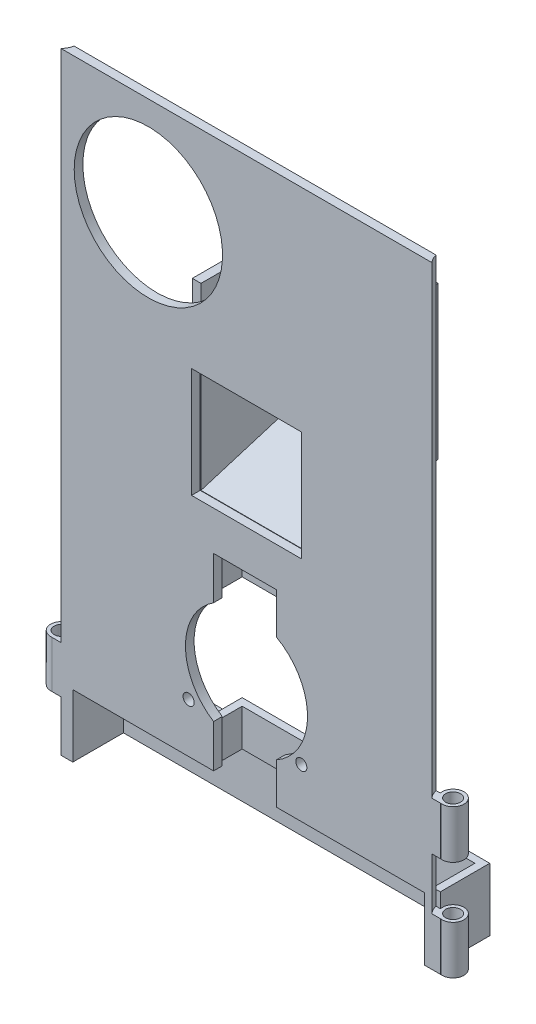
ISO-10303-21;
HEADER;
FILE_DESCRIPTION(('STEP AP214'),'2;1');
FILE_NAME('part.step','',(''),(''),'','','');
FILE_SCHEMA(('AUTOMOTIVE_DESIGN { 1 0 10303 214 1 1 1 1 }'));
ENDSEC;
DATA;
#1=APPLICATION_CONTEXT('core data for automotive mechanical design processes');
#2=APPLICATION_PROTOCOL_DEFINITION('international standard','automotive_design',2000,#1);
#3=PRODUCT_CONTEXT('',#1,'mechanical');
#4=PRODUCT('Part','Part','',(#3));
#5=PRODUCT_RELATED_PRODUCT_CATEGORY('part','',(#4));
#6=PRODUCT_DEFINITION_FORMATION('','',#4);
#7=PRODUCT_DEFINITION_CONTEXT('part definition',#1,'design');
#8=PRODUCT_DEFINITION('design','',#6,#7);
#9=PRODUCT_DEFINITION_SHAPE('','',#8);
#10=(LENGTH_UNIT() NAMED_UNIT(*) SI_UNIT(.MILLI.,.METRE.));
#11=(NAMED_UNIT(*) PLANE_ANGLE_UNIT() SI_UNIT($,.RADIAN.));
#12=(NAMED_UNIT(*) SI_UNIT($,.STERADIAN.) SOLID_ANGLE_UNIT());
#13=UNCERTAINTY_MEASURE_WITH_UNIT(LENGTH_MEASURE(1.E-05),#10,'distance_accuracy_value','');
#14=(GEOMETRIC_REPRESENTATION_CONTEXT(3) GLOBAL_UNCERTAINTY_ASSIGNED_CONTEXT((#13)) GLOBAL_UNIT_ASSIGNED_CONTEXT((#10,
#11,#12)) REPRESENTATION_CONTEXT('',''));
#15=CARTESIAN_POINT('',(0.,0.,0.));
#16=DIRECTION('',(0.,0.,1.));
#17=DIRECTION('',(1.,0.,0.));
#18=AXIS2_PLACEMENT_3D('',#15,#16,#17);
#19=CARTESIAN_POINT('',(0.,0.,0.));
#20=DIRECTION('',(0.,0.,-1.));
#21=DIRECTION('',(-1.,0.,0.));
#22=AXIS2_PLACEMENT_3D('',#19,#20,#21);
#23=PLANE('',#22);
#24=CARTESIAN_POINT('',(40.3061004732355,18.16,0.));
#25=DIRECTION('',(0.,0.,-1.));
#26=DIRECTION('',(-1.,0.,0.));
#27=AXIS2_PLACEMENT_3D('',#24,#25,#26);
#28=CIRCLE('',#27,0.899999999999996);
#29=CARTESIAN_POINT('',(39.4061004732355,18.16,0.));
#30=VERTEX_POINT('',#29);
#31=EDGE_CURVE('E1125',#30,#30,#28,.T.);
#32=ORIENTED_EDGE('',*,*,#31,.F.);
#33=EDGE_LOOP('',(#32));
#34=FACE_BOUND('',#33,.T.);
#35=CARTESIAN_POINT('',(22.0683539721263,18.16,0.));
#36=DIRECTION('',(0.,0.,-1.));
#37=DIRECTION('',(-1.,0.,0.));
#38=AXIS2_PLACEMENT_3D('',#35,#36,#37);
#39=CIRCLE('',#38,0.899999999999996);
#40=CARTESIAN_POINT('',(21.1683539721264,18.16,0.));
#41=VERTEX_POINT('',#40);
#42=EDGE_CURVE('E1127',#41,#41,#39,.T.);
#43=ORIENTED_EDGE('',*,*,#42,.F.);
#44=EDGE_LOOP('',(#43));
#45=FACE_BOUND('',#44,.T.);
#46=DIRECTION('',(-1.,0.,0.));
#47=VECTOR('',#46,1.);
#48=CARTESIAN_POINT('',(38.0434592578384,10.3393671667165,0.));
#49=LINE('',#48,#47);
#50=CARTESIAN_POINT('',(25.5309951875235,10.3393671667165,0.));
#51=VERTEX_POINT('',#50);
#52=CARTESIAN_POINT('',(24.3309951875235,10.3393671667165,0.));
#53=VERTEX_POINT('',#52);
#54=EDGE_CURVE('E569',#51,#53,#49,.T.);
#55=ORIENTED_EDGE('',*,*,#54,.F.);
#56=DIRECTION('',(0.,1.,0.));
#57=VECTOR('',#56,1.);
#58=CARTESIAN_POINT('',(25.5309951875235,0.,0.));
#59=LINE('',#58,#57);
#60=CARTESIAN_POINT('',(25.5309951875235,16.3393671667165,0.));
#61=VERTEX_POINT('',#60);
#62=EDGE_CURVE('E58',#51,#61,#59,.T.);
#63=ORIENTED_EDGE('',*,*,#62,.T.);
#64=DIRECTION('',(1.,0.,0.));
#65=VECTOR('',#64,1.);
#66=CARTESIAN_POINT('',(38.0434592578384,16.3393671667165,0.));
#67=LINE('',#66,#65);
#68=CARTESIAN_POINT('',(24.3309951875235,16.3393671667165,0.));
#69=VERTEX_POINT('',#68);
#70=EDGE_CURVE('E560',#69,#61,#67,.T.);
#71=ORIENTED_EDGE('',*,*,#70,.F.);
#72=DIRECTION('',(0.,1.,0.));
#73=VECTOR('',#72,1.);
#74=CARTESIAN_POINT('',(24.3309951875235,10.3393671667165,0.));
#75=LINE('',#74,#73);
#76=EDGE_CURVE('E573',#53,#69,#75,.T.);
#77=ORIENTED_EDGE('',*,*,#76,.F.);
#78=EDGE_LOOP('',(#55,#63,#71,#77));
#79=FACE_BOUND('',#78,.T.);
#80=DIRECTION('',(-1.,0.,0.));
#81=VECTOR('',#80,1.);
#82=CARTESIAN_POINT('',(38.0434592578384,34.4606328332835,0.));
#83=LINE('',#82,#81);
#84=CARTESIAN_POINT('',(25.5309951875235,34.4606328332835,0.));
#85=VERTEX_POINT('',#84);
#86=CARTESIAN_POINT('',(24.3309951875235,34.4606328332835,0.));
#87=VERTEX_POINT('',#86);
#88=EDGE_CURVE('E608',#85,#87,#83,.T.);
#89=ORIENTED_EDGE('',*,*,#88,.F.);
#90=CARTESIAN_POINT('',(25.5309951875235,40.4606328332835,0.));
#91=VERTEX_POINT('',#90);
#92=EDGE_CURVE('E527',#85,#91,#59,.T.);
#93=ORIENTED_EDGE('',*,*,#92,.T.);
#94=DIRECTION('',(1.,0.,0.));
#95=VECTOR('',#94,1.);
#96=CARTESIAN_POINT('',(38.0434592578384,40.4606328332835,0.));
#97=LINE('',#96,#95);
#98=CARTESIAN_POINT('',(24.3309951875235,40.4606328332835,0.));
#99=VERTEX_POINT('',#98);
#100=EDGE_CURVE('E603',#99,#91,#97,.T.);
#101=ORIENTED_EDGE('',*,*,#100,.F.);
#102=DIRECTION('',(0.,1.,0.));
#103=VECTOR('',#102,1.);
#104=CARTESIAN_POINT('',(24.3309951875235,40.4606328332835,0.));
#105=LINE('',#104,#103);
#106=EDGE_CURVE('E588',#87,#99,#105,.T.);
#107=ORIENTED_EDGE('',*,*,#106,.F.);
#108=EDGE_LOOP('',(#89,#93,#101,#107));
#109=FACE_BOUND('',#108,.T.);
#110=CARTESIAN_POINT('',(36.8434592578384,16.3393671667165,0.));
#111=VERTEX_POINT('',#110);
#112=CARTESIAN_POINT('',(38.0434592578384,16.3393671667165,0.));
#113=VERTEX_POINT('',#112);
#114=EDGE_CURVE('E575',#111,#113,#67,.T.);
#115=ORIENTED_EDGE('',*,*,#114,.F.);
#116=DIRECTION('',(0.,1.,0.));
#117=VECTOR('',#116,1.);
#118=CARTESIAN_POINT('',(36.8434592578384,0.,0.));
#119=LINE('',#118,#117);
#120=CARTESIAN_POINT('',(36.8434592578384,10.3393671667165,0.));
#121=VERTEX_POINT('',#120);
#122=EDGE_CURVE('E534',#121,#111,#119,.T.);
#123=ORIENTED_EDGE('',*,*,#122,.F.);
#124=CARTESIAN_POINT('',(38.0434592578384,10.3393671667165,0.));
#125=VERTEX_POINT('',#124);
#126=EDGE_CURVE('E570',#125,#121,#49,.T.);
#127=ORIENTED_EDGE('',*,*,#126,.F.);
#128=DIRECTION('',(0.,-1.,0.));
#129=VECTOR('',#128,1.);
#130=CARTESIAN_POINT('',(38.0434592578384,10.3393671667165,0.));
#131=LINE('',#130,#129);
#132=EDGE_CURVE('E555',#113,#125,#131,.T.);
#133=ORIENTED_EDGE('',*,*,#132,.F.);
#134=EDGE_LOOP('',(#115,#123,#127,#133));
#135=FACE_BOUND('',#134,.T.);
#136=CARTESIAN_POINT('',(36.8434592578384,34.4606328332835,0.));
#137=VERTEX_POINT('',#136);
#138=CARTESIAN_POINT('',(36.8434592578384,40.4606328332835,0.));
#139=VERTEX_POINT('',#138);
#140=EDGE_CURVE('E50',#137,#139,#119,.T.);
#141=ORIENTED_EDGE('',*,*,#140,.F.);
#142=CARTESIAN_POINT('',(38.0434592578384,34.4606328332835,0.));
#143=VERTEX_POINT('',#142);
#144=EDGE_CURVE('E593',#143,#137,#83,.T.);
#145=ORIENTED_EDGE('',*,*,#144,.F.);
#146=DIRECTION('',(0.,-1.,0.));
#147=VECTOR('',#146,1.);
#148=CARTESIAN_POINT('',(38.0434592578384,40.4606328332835,0.));
#149=LINE('',#148,#147);
#150=CARTESIAN_POINT('',(38.0434592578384,40.4606328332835,0.));
#151=VERTEX_POINT('',#150);
#152=EDGE_CURVE('E606',#151,#143,#149,.T.);
#153=ORIENTED_EDGE('',*,*,#152,.F.);
#154=EDGE_CURVE('E602',#139,#151,#97,.T.);
#155=ORIENTED_EDGE('',*,*,#154,.F.);
#156=EDGE_LOOP('',(#141,#145,#153,#155));
#157=FACE_BOUND('',#156,.T.);
#158=DIRECTION('',(-1.,0.,0.));
#159=VECTOR('',#158,1.);
#160=CARTESIAN_POINT('',(41.8497981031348,45.59,0.));
#161=LINE('',#160,#159);
#162=CARTESIAN_POINT('',(41.8497981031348,45.59,0.));
#163=VERTEX_POINT('',#162);
#164=CARTESIAN_POINT('',(21.2697981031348,45.59,0.));
#165=VERTEX_POINT('',#164);
#166=EDGE_CURVE('E662',#163,#165,#161,.T.);
#167=ORIENTED_EDGE('',*,*,#166,.F.);
#168=DIRECTION('',(0.,-1.,0.));
#169=VECTOR('',#168,1.);
#170=CARTESIAN_POINT('',(41.8497981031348,76.07,0.));
#171=LINE('',#170,#169);
#172=CARTESIAN_POINT('',(41.8497981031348,76.07,0.));
#173=VERTEX_POINT('',#172);
#174=EDGE_CURVE('E675',#173,#163,#171,.T.);
#175=ORIENTED_EDGE('',*,*,#174,.F.);
#176=DIRECTION('',(1.,0.,0.));
#177=VECTOR('',#176,1.);
#178=CARTESIAN_POINT('',(41.8497981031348,76.07,0.));
#179=LINE('',#178,#177);
#180=CARTESIAN_POINT('',(40.4497981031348,76.07,0.));
#181=VERTEX_POINT('',#180);
#182=EDGE_CURVE('E671',#181,#173,#179,.T.);
#183=ORIENTED_EDGE('',*,*,#182,.F.);
#184=DIRECTION('',(0.,1.,0.));
#185=VECTOR('',#184,1.);
#186=CARTESIAN_POINT('',(40.4497981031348,22.646312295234,0.));
#187=LINE('',#186,#185);
#188=CARTESIAN_POINT('',(40.4497981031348,47.0535015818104,0.));
#189=VERTEX_POINT('',#188);
#190=EDGE_CURVE('E641',#189,#181,#187,.T.);
#191=ORIENTED_EDGE('',*,*,#190,.F.);
#192=DIRECTION('',(-1.,0.,0.));
#193=VECTOR('',#192,1.);
#194=CARTESIAN_POINT('',(22.6697981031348,47.0535015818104,0.));
#195=LINE('',#194,#193);
#196=CARTESIAN_POINT('',(40.3225,47.0535015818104,0.));
#197=VERTEX_POINT('',#196);
#198=EDGE_CURVE('E646',#189,#197,#195,.T.);
#199=ORIENTED_EDGE('',*,*,#198,.T.);
#200=DIRECTION('',(0.,-1.,0.));
#201=VECTOR('',#200,1.);
#202=CARTESIAN_POINT('',(40.3225,64.77,0.));
#203=LINE('',#202,#201);
#204=CARTESIAN_POINT('',(40.3225,64.77,0.));
#205=VERTEX_POINT('',#204);
#206=EDGE_CURVE('E793',#205,#197,#203,.T.);
#207=ORIENTED_EDGE('',*,*,#206,.F.);
#208=DIRECTION('',(1.,0.,0.));
#209=VECTOR('',#208,1.);
#210=CARTESIAN_POINT('',(40.3225,64.77,0.));
#211=LINE('',#210,#209);
#212=CARTESIAN_POINT('',(22.6697981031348,64.77,0.));
#213=VERTEX_POINT('',#212);
#214=EDGE_CURVE('E649',#213,#205,#211,.T.);
#215=ORIENTED_EDGE('',*,*,#214,.F.);
#216=DIRECTION('',(0.,1.,0.));
#217=VECTOR('',#216,1.);
#218=CARTESIAN_POINT('',(22.6697981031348,22.646312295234,0.));
#219=LINE('',#218,#217);
#220=CARTESIAN_POINT('',(22.6697981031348,73.5185266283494,0.));
#221=VERTEX_POINT('',#220);
#222=EDGE_CURVE('E637',#213,#221,#219,.T.);
#223=ORIENTED_EDGE('',*,*,#222,.T.);
#224=CARTESIAN_POINT('',(15.5525,83.18,0.));
#225=DIRECTION('',(0.,0.,-1.));
#226=DIRECTION('',(-1.,0.,0.));
#227=AXIS2_PLACEMENT_3D('',#224,#225,#226);
#228=CIRCLE('',#227,12.);
#229=CARTESIAN_POINT('',(21.2697981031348,72.6295259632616,0.));
#230=VERTEX_POINT('',#229);
#231=EDGE_CURVE('E780',#230,#221,#228,.T.);
#232=ORIENTED_EDGE('',*,*,#231,.F.);
#233=DIRECTION('',(0.,1.,0.));
#234=VECTOR('',#233,1.);
#235=CARTESIAN_POINT('',(21.2697981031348,76.07,0.));
#236=LINE('',#235,#234);
#237=EDGE_CURVE('E668',#165,#230,#236,.T.);
#238=ORIENTED_EDGE('',*,*,#237,.F.);
#239=EDGE_LOOP('',(#167,#175,#183,#191,#199,#207,#215,#223,#232,#238));
#240=FACE_BOUND('',#239,.T.);
#241=DIRECTION('',(0.,-1.,0.));
#242=VECTOR('',#241,1.);
#243=CARTESIAN_POINT('',(60.7406579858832,16.2,0.));
#244=LINE('',#243,#242);
#245=CARTESIAN_POINT('',(60.7406579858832,16.2,0.));
#246=VERTEX_POINT('',#245);
#247=CARTESIAN_POINT('',(60.7406579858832,10.16,0.));
#248=VERTEX_POINT('',#247);
#249=EDGE_CURVE('E776',#246,#248,#244,.T.);
#250=ORIENTED_EDGE('',*,*,#249,.T.);
#251=DIRECTION('',(1.,0.,0.));
#252=VECTOR('',#251,1.);
#253=CARTESIAN_POINT('',(61.4003571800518,10.16,0.));
#254=LINE('',#253,#252);
#255=CARTESIAN_POINT('',(60.2003571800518,10.16,0.));
#256=VERTEX_POINT('',#255);
#257=EDGE_CURVE('E500',#256,#248,#254,.T.);
#258=ORIENTED_EDGE('',*,*,#257,.F.);
#259=CARTESIAN_POINT('',(36.2672272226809,10.16,0.));
#260=VERTEX_POINT('',#259);
#261=EDGE_CURVE('E499',#260,#256,#254,.T.);
#262=ORIENTED_EDGE('',*,*,#261,.F.);
#263=DIRECTION('',(0.,-1.,0.));
#264=VECTOR('',#263,1.);
#265=CARTESIAN_POINT('',(36.2672272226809,16.7864293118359,0.));
#266=LINE('',#265,#264);
#267=CARTESIAN_POINT('',(36.2672272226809,16.7864293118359,0.));
#268=VERTEX_POINT('',#267);
#269=EDGE_CURVE('E823',#268,#260,#266,.T.);
#270=ORIENTED_EDGE('',*,*,#269,.F.);
#271=CARTESIAN_POINT('',(31.4325,25.4,0.));
#272=DIRECTION('',(0.,0.,-1.));
#273=DIRECTION('',(-1.,0.,0.));
#274=AXIS2_PLACEMENT_3D('',#271,#272,#273);
#275=CIRCLE('',#274,9.87766102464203);
#276=CARTESIAN_POINT('',(36.267227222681,34.0135706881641,0.));
#277=VERTEX_POINT('',#276);
#278=EDGE_CURVE('E821',#277,#268,#275,.T.);
#279=ORIENTED_EDGE('',*,*,#278,.F.);
#280=DIRECTION('',(0.,-1.,0.));
#281=VECTOR('',#280,1.);
#282=CARTESIAN_POINT('',(36.2672272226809,40.64,0.));
#283=LINE('',#282,#281);
#284=CARTESIAN_POINT('',(36.2672272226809,40.64,0.));
#285=VERTEX_POINT('',#284);
#286=EDGE_CURVE('E819',#285,#277,#283,.T.);
#287=ORIENTED_EDGE('',*,*,#286,.F.);
#288=DIRECTION('',(1.,0.,0.));
#289=VECTOR('',#288,1.);
#290=CARTESIAN_POINT('',(36.2672272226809,40.64,0.));
#291=LINE('',#290,#289);
#292=CARTESIAN_POINT('',(26.1072272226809,40.64,0.));
#293=VERTEX_POINT('',#292);
#294=EDGE_CURVE('E816',#293,#285,#291,.T.);
#295=ORIENTED_EDGE('',*,*,#294,.F.);
#296=DIRECTION('',(0.,1.,0.));
#297=VECTOR('',#296,1.);
#298=CARTESIAN_POINT('',(26.1072272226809,40.64,0.));
#299=LINE('',#298,#297);
#300=CARTESIAN_POINT('',(26.1072272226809,33.7192341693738,0.));
#301=VERTEX_POINT('',#300);
#302=EDGE_CURVE('E814',#301,#293,#299,.T.);
#303=ORIENTED_EDGE('',*,*,#302,.F.);
#304=CARTESIAN_POINT('',(31.4325,25.4,0.));
#305=DIRECTION('',(0.,0.,-1.));
#306=DIRECTION('',(-1.,0.,0.));
#307=AXIS2_PLACEMENT_3D('',#304,#305,#306);
#308=CIRCLE('',#307,9.87766102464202);
#309=CARTESIAN_POINT('',(26.1072272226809,17.0807658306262,0.));
#310=VERTEX_POINT('',#309);
#311=EDGE_CURVE('E812',#310,#301,#308,.T.);
#312=ORIENTED_EDGE('',*,*,#311,.F.);
#313=DIRECTION('',(0.,1.,0.));
#314=VECTOR('',#313,1.);
#315=CARTESIAN_POINT('',(26.1072272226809,17.0807658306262,0.));
#316=LINE('',#315,#314);
#317=CARTESIAN_POINT('',(26.1072272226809,10.16,0.));
#318=VERTEX_POINT('',#317);
#319=EDGE_CURVE('E779',#318,#310,#316,.T.);
#320=ORIENTED_EDGE('',*,*,#319,.F.);
#321=DIRECTION('',(-1.,0.,0.));
#322=VECTOR('',#321,1.);
#323=CARTESIAN_POINT('',(0.,10.16,0.));
#324=LINE('',#323,#322);
#325=CARTESIAN_POINT('',(3.32434201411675,10.16,0.));
#326=VERTEX_POINT('',#325);
#327=EDGE_CURVE('E474',#318,#326,#324,.T.);
#328=ORIENTED_EDGE('',*,*,#327,.T.);
#329=CARTESIAN_POINT('',(2.12434201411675,10.16,0.));
#330=VERTEX_POINT('',#329);
#331=EDGE_CURVE('E496',#330,#326,#254,.T.);
#332=ORIENTED_EDGE('',*,*,#331,.F.);
#333=DIRECTION('',(0.,1.,0.));
#334=VECTOR('',#333,1.);
#335=CARTESIAN_POINT('',(2.12434201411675,10.16,0.));
#336=LINE('',#335,#334);
#337=CARTESIAN_POINT('',(2.12434201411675,8.2,0.));
#338=VERTEX_POINT('',#337);
#339=EDGE_CURVE('E482',#338,#330,#336,.T.);
#340=ORIENTED_EDGE('',*,*,#339,.F.);
#341=DIRECTION('',(1.,0.,0.));
#342=VECTOR('',#341,1.);
#343=CARTESIAN_POINT('',(0.,8.2,0.));
#344=LINE('',#343,#342);
#345=CARTESIAN_POINT('',(1.46464281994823,8.2,0.));
#346=VERTEX_POINT('',#345);
#347=EDGE_CURVE('E720',#346,#338,#344,.T.);
#348=ORIENTED_EDGE('',*,*,#347,.F.);
#349=DIRECTION('',(0.,-1.,0.));
#350=VECTOR('',#349,1.);
#351=CARTESIAN_POINT('',(1.46464281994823,104.009747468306,0.));
#352=LINE('',#351,#350);
#353=CARTESIAN_POINT('',(1.46464281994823,15.8,0.));
#354=VERTEX_POINT('',#353);
#355=EDGE_CURVE('E879',#346,#354,#352,.F.);
#356=ORIENTED_EDGE('',*,*,#355,.T.);
#357=DIRECTION('',(1.,0.,0.));
#358=VECTOR('',#357,1.);
#359=CARTESIAN_POINT('',(0.,15.8,0.));
#360=LINE('',#359,#358);
#361=CARTESIAN_POINT('',(2.12434201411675,15.8,0.));
#362=VERTEX_POINT('',#361);
#363=EDGE_CURVE('E697',#354,#362,#360,.T.);
#364=ORIENTED_EDGE('',*,*,#363,.T.);
#365=DIRECTION('',(0.,-1.,0.));
#366=VECTOR('',#365,1.);
#367=CARTESIAN_POINT('',(2.12434201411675,105.848225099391,0.));
#368=LINE('',#367,#366);
#369=CARTESIAN_POINT('',(2.12434201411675,99.06,0.));
#370=VERTEX_POINT('',#369);
#371=EDGE_CURVE('E702',#362,#370,#368,.F.);
#372=ORIENTED_EDGE('',*,*,#371,.T.);
#373=DIRECTION('',(-1.,0.,0.));
#374=VECTOR('',#373,1.);
#375=CARTESIAN_POINT('',(0.,99.06,0.));
#376=LINE('',#375,#374);
#377=CARTESIAN_POINT('',(60.7406579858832,99.06,0.));
#378=VERTEX_POINT('',#377);
#379=EDGE_CURVE('E861',#378,#370,#376,.T.);
#380=ORIENTED_EDGE('',*,*,#379,.F.);
#381=DIRECTION('',(0.,-1.,0.));
#382=VECTOR('',#381,1.);
#383=CARTESIAN_POINT('',(60.7406579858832,105.848225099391,0.));
#384=LINE('',#383,#382);
#385=CARTESIAN_POINT('',(60.7406579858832,24.,0.));
#386=VERTEX_POINT('',#385);
#387=EDGE_CURVE('E745',#378,#386,#384,.T.);
#388=ORIENTED_EDGE('',*,*,#387,.T.);
#389=DIRECTION('',(1.,0.,0.));
#390=VECTOR('',#389,1.);
#391=CARTESIAN_POINT('',(0.,24.,0.));
#392=LINE('',#391,#390);
#393=CARTESIAN_POINT('',(61.4003571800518,24.,0.));
#394=VERTEX_POINT('',#393);
#395=EDGE_CURVE('E740',#386,#394,#392,.T.);
#396=ORIENTED_EDGE('',*,*,#395,.T.);
#397=DIRECTION('',(0.,-1.,0.));
#398=VECTOR('',#397,1.);
#399=CARTESIAN_POINT('',(61.4003571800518,104.009747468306,0.));
#400=LINE('',#399,#398);
#401=CARTESIAN_POINT('',(61.4003571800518,16.2,0.));
#402=VERTEX_POINT('',#401);
#403=EDGE_CURVE('E856',#394,#402,#400,.T.);
#404=ORIENTED_EDGE('',*,*,#403,.T.);
#405=DIRECTION('',(1.,0.,0.));
#406=VECTOR('',#405,1.);
#407=CARTESIAN_POINT('',(0.,16.2,0.));
#408=LINE('',#407,#406);
#409=EDGE_CURVE('E770',#246,#402,#408,.T.);
#410=ORIENTED_EDGE('',*,*,#409,.F.);
#411=EDGE_LOOP('',(#250,#258,#262,#270,#279,#287,#295,#303,#312,#320,#328,#332,#340,#348,#356,
#364,#372,#380,#388,#396,#404,#410));
#412=FACE_BOUND('',#411,.T.);
#413=ADVANCED_FACE('F35',(#34,#45,#79,#109,#135,#157,#240,#412),#23,.T.);
#414=CARTESIAN_POINT('',(63.115,104.009747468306,-0.349999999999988));
#415=DIRECTION('',(0.,-1.,0.));
#416=DIRECTION('',(0.,0.,-1.));
#417=AXIS2_PLACEMENT_3D('',#414,#415,#416);
#418=CYLINDRICAL_SURFACE('',#417,1.75);
#419=DIRECTION('',(0.,-1.,0.));
#420=VECTOR('',#419,1.);
#421=CARTESIAN_POINT('',(61.4003571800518,104.009747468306,-0.699999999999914));
#422=LINE('',#421,#420);
#423=CARTESIAN_POINT('',(61.4003571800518,7.8,-0.699999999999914));
#424=VERTEX_POINT('',#423);
#425=CARTESIAN_POINT('',(61.4003571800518,0.,-0.699999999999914));
#426=VERTEX_POINT('',#425);
#427=EDGE_CURVE('E516',#424,#426,#422,.T.);
#428=ORIENTED_EDGE('',*,*,#427,.F.);
#429=CARTESIAN_POINT('',(63.115,7.8,-0.349999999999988));
#430=DIRECTION('',(0.,1.,0.));
#431=DIRECTION('',(0.,0.,1.));
#432=AXIS2_PLACEMENT_3D('',#429,#430,#431);
#433=CIRCLE('',#432,1.75);
#434=CARTESIAN_POINT('',(62.865,7.8,1.38205080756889));
#435=VERTEX_POINT('',#434);
#436=EDGE_CURVE('E754',#435,#424,#433,.T.);
#437=ORIENTED_EDGE('',*,*,#436,.F.);
#438=DIRECTION('',(0.,-1.,0.));
#439=VECTOR('',#438,1.);
#440=CARTESIAN_POINT('',(62.865,104.009747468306,1.38205080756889));
#441=LINE('',#440,#439);
#442=CARTESIAN_POINT('',(62.865,0.,1.38205080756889));
#443=VERTEX_POINT('',#442);
#444=EDGE_CURVE('E853',#435,#443,#441,.T.);
#445=ORIENTED_EDGE('',*,*,#444,.T.);
#446=CARTESIAN_POINT('',(63.115,0.,-0.349999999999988));
#447=DIRECTION('',(0.,1.,0.));
#448=DIRECTION('',(0.,0.,-1.));
#449=AXIS2_PLACEMENT_3D('',#446,#447,#448);
#450=CIRCLE('',#449,1.75);
#451=EDGE_CURVE('E850',#443,#426,#450,.T.);
#452=ORIENTED_EDGE('',*,*,#451,.T.);
#453=EDGE_LOOP('',(#428,#437,#445,#452));
#454=FACE_BOUND('',#453,.T.);
#455=ADVANCED_FACE('F983',(#454),#418,.T.);
#456=CARTESIAN_POINT('',(63.115,7.8,-0.349999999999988));
#457=DIRECTION('',(0.,1.,0.));
#458=DIRECTION('',(0.,0.,1.));
#459=AXIS2_PLACEMENT_3D('',#456,#457,#458);
#460=PLANE('',#459);
#461=CARTESIAN_POINT('',(63.115,7.8,-0.349999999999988));
#462=DIRECTION('',(0.,1.,0.));
#463=DIRECTION('',(0.,0.,1.));
#464=AXIS2_PLACEMENT_3D('',#461,#462,#463);
#465=CIRCLE('',#464,1.19999999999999);
#466=CARTESIAN_POINT('',(63.115,7.8,0.849999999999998));
#467=VERTEX_POINT('',#466);
#468=EDGE_CURVE('E753',#467,#467,#465,.F.);
#469=ORIENTED_EDGE('',*,*,#468,.T.);
#470=EDGE_LOOP('',(#469));
#471=FACE_BOUND('',#470,.T.);
#472=ORIENTED_EDGE('',*,*,#436,.T.);
#473=DIRECTION('',(0.,0.,1.));
#474=VECTOR('',#473,1.);
#475=CARTESIAN_POINT('',(61.4003571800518,7.8,-0.349999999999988));
#476=LINE('',#475,#474);
#477=CARTESIAN_POINT('',(61.4003571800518,7.8,0.));
#478=VERTEX_POINT('',#477);
#479=EDGE_CURVE('E12',#424,#478,#476,.T.);
#480=ORIENTED_EDGE('',*,*,#479,.T.);
#481=DIRECTION('',(1.,0.,0.));
#482=VECTOR('',#481,1.);
#483=CARTESIAN_POINT('',(0.,7.8,0.));
#484=LINE('',#483,#482);
#485=CARTESIAN_POINT('',(60.7406579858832,7.8,0.));
#486=VERTEX_POINT('',#485);
#487=EDGE_CURVE('E759',#486,#478,#484,.T.);
#488=ORIENTED_EDGE('',*,*,#487,.F.);
#489=CARTESIAN_POINT('',(63.115,7.8,-0.349999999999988));
#490=DIRECTION('',(0.,1.,0.));
#491=DIRECTION('',(0.,0.,1.));
#492=AXIS2_PLACEMENT_3D('',#489,#490,#491);
#493=CIRCLE('',#492,2.4);
#494=CARTESIAN_POINT('',(61.4725932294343,7.8,1.4));
#495=VERTEX_POINT('',#494);
#496=EDGE_CURVE('E747',#486,#495,#493,.T.);
#497=ORIENTED_EDGE('',*,*,#496,.T.);
#498=DIRECTION('',(1.,0.,0.));
#499=VECTOR('',#498,1.);
#500=CARTESIAN_POINT('',(0.,7.8,1.4));
#501=LINE('',#500,#499);
#502=CARTESIAN_POINT('',(62.865,7.8,1.4));
#503=VERTEX_POINT('',#502);
#504=EDGE_CURVE('E761',#495,#503,#501,.T.);
#505=ORIENTED_EDGE('',*,*,#504,.T.);
#506=DIRECTION('',(0.,0.,-1.));
#507=VECTOR('',#506,1.);
#508=CARTESIAN_POINT('',(62.865,7.8,1.4));
#509=LINE('',#508,#507);
#510=EDGE_CURVE('E757',#503,#435,#509,.T.);
#511=ORIENTED_EDGE('',*,*,#510,.T.);
#512=EDGE_LOOP('',(#472,#480,#488,#497,#505,#511));
#513=FACE_BOUND('',#512,.T.);
#514=ADVANCED_FACE('F989',(#471,#513),#460,.T.);
#515=CARTESIAN_POINT('',(0.,0.,1.4));
#516=DIRECTION('',(0.,0.,-1.));
#517=DIRECTION('',(-1.,0.,0.));
#518=AXIS2_PLACEMENT_3D('',#515,#516,#517);
#519=PLANE('',#518);
#520=CARTESIAN_POINT('',(40.3061004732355,18.16,1.4));
#521=DIRECTION('',(0.,0.,1.));
#522=DIRECTION('',(1.,0.,0.));
#523=AXIS2_PLACEMENT_3D('',#520,#521,#522);
#524=CIRCLE('',#523,0.899999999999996);
#525=CARTESIAN_POINT('',(41.2061004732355,18.16,1.4));
#526=VERTEX_POINT('',#525);
#527=EDGE_CURVE('E1131',#526,#526,#524,.T.);
#528=ORIENTED_EDGE('',*,*,#527,.F.);
#529=EDGE_LOOP('',(#528));
#530=FACE_BOUND('',#529,.T.);
#531=CARTESIAN_POINT('',(22.0683539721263,18.16,1.4));
#532=DIRECTION('',(0.,0.,1.));
#533=DIRECTION('',(-1.,0.,0.));
#534=AXIS2_PLACEMENT_3D('',#531,#532,#533);
#535=CIRCLE('',#534,0.899999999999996);
#536=CARTESIAN_POINT('',(21.1683539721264,18.16,1.4));
#537=VERTEX_POINT('',#536);
#538=EDGE_CURVE('E1285',#537,#537,#535,.T.);
#539=ORIENTED_EDGE('',*,*,#538,.F.);
#540=EDGE_LOOP('',(#539));
#541=FACE_BOUND('',#540,.T.);
#542=CARTESIAN_POINT('',(15.5525,83.18,1.4));
#543=DIRECTION('',(0.,0.,-1.));
#544=DIRECTION('',(-1.,0.,0.));
#545=AXIS2_PLACEMENT_3D('',#542,#543,#544);
#546=CIRCLE('',#545,12.);
#547=CARTESIAN_POINT('',(3.55250000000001,83.18,1.4));
#548=VERTEX_POINT('',#547);
#549=EDGE_CURVE('E783',#548,#548,#546,.T.);
#550=ORIENTED_EDGE('',*,*,#549,.T.);
#551=EDGE_LOOP('',(#550));
#552=FACE_BOUND('',#551,.T.);
#553=DIRECTION('',(-1.,0.,0.));
#554=VECTOR('',#553,1.);
#555=CARTESIAN_POINT('',(0.,46.99,1.4));
#556=LINE('',#555,#554);
#557=CARTESIAN_POINT('',(40.3225,46.99,1.4));
#558=VERTEX_POINT('',#557);
#559=CARTESIAN_POINT('',(22.5425,46.99,1.4));
#560=VERTEX_POINT('',#559);
#561=EDGE_CURVE('E909',#558,#560,#556,.T.);
#562=ORIENTED_EDGE('',*,*,#561,.T.);
#563=DIRECTION('',(0.,1.,0.));
#564=VECTOR('',#563,1.);
#565=CARTESIAN_POINT('',(22.5425,0.,1.4));
#566=LINE('',#565,#564);
#567=CARTESIAN_POINT('',(22.5425,64.77,1.4));
#568=VERTEX_POINT('',#567);
#569=EDGE_CURVE('E912',#560,#568,#566,.T.);
#570=ORIENTED_EDGE('',*,*,#569,.T.);
#571=DIRECTION('',(1.,0.,0.));
#572=VECTOR('',#571,1.);
#573=CARTESIAN_POINT('',(0.,64.77,1.4));
#574=LINE('',#573,#572);
#575=CARTESIAN_POINT('',(40.3225,64.77,1.4));
#576=VERTEX_POINT('',#575);
#577=EDGE_CURVE('E903',#568,#576,#574,.T.);
#578=ORIENTED_EDGE('',*,*,#577,.T.);
#579=DIRECTION('',(0.,-1.,0.));
#580=VECTOR('',#579,1.);
#581=CARTESIAN_POINT('',(40.3225,0.,1.4));
#582=LINE('',#581,#580);
#583=EDGE_CURVE('E906',#576,#558,#582,.T.);
#584=ORIENTED_EDGE('',*,*,#583,.T.);
#585=EDGE_LOOP('',(#562,#570,#578,#584));
#586=FACE_BOUND('',#585,.T.);
#587=DIRECTION('',(-1.,0.,0.));
#588=VECTOR('',#587,1.);
#589=CARTESIAN_POINT('',(0.,10.16,1.4));
#590=LINE('',#589,#588);
#591=CARTESIAN_POINT('',(60.2003571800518,10.16,1.4));
#592=VERTEX_POINT('',#591);
#593=CARTESIAN_POINT('',(36.2672272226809,10.16,1.4));
#594=VERTEX_POINT('',#593);
#595=EDGE_CURVE('E471',#592,#594,#590,.T.);
#596=ORIENTED_EDGE('',*,*,#595,.F.);
#597=DIRECTION('',(0.,-1.,0.));
#598=VECTOR('',#597,1.);
#599=CARTESIAN_POINT('',(60.2003571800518,0.,1.4));
#600=LINE('',#599,#598);
#601=CARTESIAN_POINT('',(60.2003571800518,0.,1.40000000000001));
#602=VERTEX_POINT('',#601);
#603=EDGE_CURVE('E479',#592,#602,#600,.T.);
#604=ORIENTED_EDGE('',*,*,#603,.T.);
#605=DIRECTION('',(1.,0.,0.));
#606=VECTOR('',#605,1.);
#607=CARTESIAN_POINT('',(0.,0.,1.4));
#608=LINE('',#607,#606);
#609=CARTESIAN_POINT('',(62.865,0.,1.4));
#610=VERTEX_POINT('',#609);
#611=EDGE_CURVE('E864',#602,#610,#608,.T.);
#612=ORIENTED_EDGE('',*,*,#611,.T.);
#613=DIRECTION('',(0.,1.,0.));
#614=VECTOR('',#613,1.);
#615=CARTESIAN_POINT('',(62.865,0.,1.4));
#616=LINE('',#615,#614);
#617=EDGE_CURVE('E868',#610,#503,#616,.T.);
#618=ORIENTED_EDGE('',*,*,#617,.T.);
#619=ORIENTED_EDGE('',*,*,#504,.F.);
#620=DIRECTION('',(0.,-1.,0.));
#621=VECTOR('',#620,1.);
#622=CARTESIAN_POINT('',(61.4725932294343,16.2,1.4));
#623=LINE('',#622,#621);
#624=CARTESIAN_POINT('',(61.4725932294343,16.2,1.4));
#625=VERTEX_POINT('',#624);
#626=EDGE_CURVE('E915',#625,#495,#623,.T.);
#627=ORIENTED_EDGE('',*,*,#626,.F.);
#628=DIRECTION('',(1.,0.,0.));
#629=VECTOR('',#628,1.);
#630=CARTESIAN_POINT('',(0.,16.2,1.4));
#631=LINE('',#630,#629);
#632=CARTESIAN_POINT('',(62.865,16.2,1.4));
#633=VERTEX_POINT('',#632);
#634=EDGE_CURVE('E773',#625,#633,#631,.T.);
#635=ORIENTED_EDGE('',*,*,#634,.T.);
#636=CARTESIAN_POINT('',(62.865,24.,1.4));
#637=VERTEX_POINT('',#636);
#638=EDGE_CURVE('E867',#633,#637,#616,.T.);
#639=ORIENTED_EDGE('',*,*,#638,.T.);
#640=DIRECTION('',(1.,0.,0.));
#641=VECTOR('',#640,1.);
#642=CARTESIAN_POINT('',(0.,24.,1.4));
#643=LINE('',#642,#641);
#644=CARTESIAN_POINT('',(61.4725932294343,24.,1.4));
#645=VERTEX_POINT('',#644);
#646=EDGE_CURVE('E743',#645,#637,#643,.T.);
#647=ORIENTED_EDGE('',*,*,#646,.F.);
#648=DIRECTION('',(0.,-1.,0.));
#649=VECTOR('',#648,1.);
#650=CARTESIAN_POINT('',(61.4725932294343,105.848225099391,1.4));
#651=LINE('',#650,#649);
#652=CARTESIAN_POINT('',(61.4725932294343,99.06,1.4));
#653=VERTEX_POINT('',#652);
#654=EDGE_CURVE('E923',#653,#645,#651,.T.);
#655=ORIENTED_EDGE('',*,*,#654,.F.);
#656=DIRECTION('',(-1.,0.,0.));
#657=VECTOR('',#656,1.);
#658=CARTESIAN_POINT('',(0.,99.06,1.4));
#659=LINE('',#658,#657);
#660=CARTESIAN_POINT('',(1.3924067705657,99.06,1.4));
#661=VERTEX_POINT('',#660);
#662=EDGE_CURVE('E871',#653,#661,#659,.T.);
#663=ORIENTED_EDGE('',*,*,#662,.T.);
#664=DIRECTION('',(0.,-1.,0.));
#665=VECTOR('',#664,1.);
#666=CARTESIAN_POINT('',(1.3924067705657,105.848225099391,1.4));
#667=LINE('',#666,#665);
#668=CARTESIAN_POINT('',(1.3924067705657,15.8,1.4));
#669=VERTEX_POINT('',#668);
#670=EDGE_CURVE('E700',#669,#661,#667,.F.);
#671=ORIENTED_EDGE('',*,*,#670,.F.);
#672=DIRECTION('',(1.,0.,0.));
#673=VECTOR('',#672,1.);
#674=CARTESIAN_POINT('',(0.,15.8,1.4));
#675=LINE('',#674,#673);
#676=CARTESIAN_POINT('',(0.,15.8,1.4));
#677=VERTEX_POINT('',#676);
#678=EDGE_CURVE('E695',#677,#669,#675,.T.);
#679=ORIENTED_EDGE('',*,*,#678,.F.);
#680=DIRECTION('',(0.,-1.,0.));
#681=VECTOR('',#680,1.);
#682=CARTESIAN_POINT('',(0.,0.,1.4));
#683=LINE('',#682,#681);
#684=CARTESIAN_POINT('',(0.,8.2,1.4));
#685=VERTEX_POINT('',#684);
#686=EDGE_CURVE('E862',#677,#685,#683,.T.);
#687=ORIENTED_EDGE('',*,*,#686,.T.);
#688=DIRECTION('',(1.,0.,0.));
#689=VECTOR('',#688,1.);
#690=CARTESIAN_POINT('',(0.,8.2,1.4));
#691=LINE('',#690,#689);
#692=CARTESIAN_POINT('',(1.3924067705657,8.2,1.4));
#693=VERTEX_POINT('',#692);
#694=EDGE_CURVE('E717',#685,#693,#691,.T.);
#695=ORIENTED_EDGE('',*,*,#694,.T.);
#696=DIRECTION('',(0.,1.,0.));
#697=VECTOR('',#696,1.);
#698=CARTESIAN_POINT('',(1.3924067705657,-6.78822509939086,1.4));
#699=LINE('',#698,#697);
#700=CARTESIAN_POINT('',(1.3924067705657,0.,1.4));
#701=VERTEX_POINT('',#700);
#702=EDGE_CURVE('E723',#693,#701,#699,.F.);
#703=ORIENTED_EDGE('',*,*,#702,.T.);
#704=CARTESIAN_POINT('',(3.32434201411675,0.,1.40000000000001));
#705=VERTEX_POINT('',#704);
#706=EDGE_CURVE('E865',#701,#705,#608,.T.);
#707=ORIENTED_EDGE('',*,*,#706,.T.);
#708=DIRECTION('',(0.,1.,0.));
#709=VECTOR('',#708,1.);
#710=CARTESIAN_POINT('',(3.32434201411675,0.,1.4));
#711=LINE('',#710,#709);
#712=CARTESIAN_POINT('',(3.32434201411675,10.16,1.4));
#713=VERTEX_POINT('',#712);
#714=EDGE_CURVE('E446',#705,#713,#711,.T.);
#715=ORIENTED_EDGE('',*,*,#714,.T.);
#716=CARTESIAN_POINT('',(26.1072272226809,10.16,1.4));
#717=VERTEX_POINT('',#716);
#718=EDGE_CURVE('E473',#717,#713,#590,.T.);
#719=ORIENTED_EDGE('',*,*,#718,.F.);
#720=DIRECTION('',(0.,1.,0.));
#721=VECTOR('',#720,1.);
#722=CARTESIAN_POINT('',(26.1072272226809,0.,1.4));
#723=LINE('',#722,#721);
#724=CARTESIAN_POINT('',(26.1072272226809,17.0807658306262,1.4));
#725=VERTEX_POINT('',#724);
#726=EDGE_CURVE('E900',#717,#725,#723,.T.);
#727=ORIENTED_EDGE('',*,*,#726,.T.);
#728=CARTESIAN_POINT('',(31.4325,25.4,1.4));
#729=DIRECTION('',(0.,0.,-1.));
#730=DIRECTION('',(-1.,0.,0.));
#731=AXIS2_PLACEMENT_3D('',#728,#729,#730);
#732=CIRCLE('',#731,9.87766102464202);
#733=CARTESIAN_POINT('',(26.1072272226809,33.7192341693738,1.4));
#734=VERTEX_POINT('',#733);
#735=EDGE_CURVE('E882',#725,#734,#732,.T.);
#736=ORIENTED_EDGE('',*,*,#735,.T.);
#737=DIRECTION('',(0.,1.,0.));
#738=VECTOR('',#737,1.);
#739=CARTESIAN_POINT('',(26.1072272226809,0.,1.4));
#740=LINE('',#739,#738);
#741=CARTESIAN_POINT('',(26.1072272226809,40.64,1.4));
#742=VERTEX_POINT('',#741);
#743=EDGE_CURVE('E885',#734,#742,#740,.T.);
#744=ORIENTED_EDGE('',*,*,#743,.T.);
#745=DIRECTION('',(1.,0.,0.));
#746=VECTOR('',#745,1.);
#747=CARTESIAN_POINT('',(0.,40.64,1.4));
#748=LINE('',#747,#746);
#749=CARTESIAN_POINT('',(36.2672272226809,40.64,1.4));
#750=VERTEX_POINT('',#749);
#751=EDGE_CURVE('E888',#742,#750,#748,.T.);
#752=ORIENTED_EDGE('',*,*,#751,.T.);
#753=DIRECTION('',(0.,-1.,0.));
#754=VECTOR('',#753,1.);
#755=CARTESIAN_POINT('',(36.2672272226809,0.,1.4));
#756=LINE('',#755,#754);
#757=CARTESIAN_POINT('',(36.267227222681,34.0135706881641,1.4));
#758=VERTEX_POINT('',#757);
#759=EDGE_CURVE('E891',#750,#758,#756,.T.);
#760=ORIENTED_EDGE('',*,*,#759,.T.);
#761=CARTESIAN_POINT('',(31.4325,25.4,1.4));
#762=DIRECTION('',(0.,0.,-1.));
#763=DIRECTION('',(-1.,0.,0.));
#764=AXIS2_PLACEMENT_3D('',#761,#762,#763);
#765=CIRCLE('',#764,9.87766102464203);
#766=CARTESIAN_POINT('',(36.2672272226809,16.7864293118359,1.4));
#767=VERTEX_POINT('',#766);
#768=EDGE_CURVE('E894',#758,#767,#765,.T.);
#769=ORIENTED_EDGE('',*,*,#768,.T.);
#770=DIRECTION('',(0.,-1.,0.));
#771=VECTOR('',#770,1.);
#772=CARTESIAN_POINT('',(36.2672272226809,0.,1.4));
#773=LINE('',#772,#771);
#774=EDGE_CURVE('E897',#767,#594,#773,.T.);
#775=ORIENTED_EDGE('',*,*,#774,.T.);
#776=EDGE_LOOP('',(#596,#604,#612,#618,#619,#627,#635,#639,#647,#655,#663,#671,#679,#687,#695,
#703,#707,#715,#719,#727,#736,#744,#752,#760,#769,#775));
#777=FACE_BOUND('',#776,.T.);
#778=ADVANCED_FACE('F997',(#530,#541,#552,#586,#777),#519,.F.);
#779=CARTESIAN_POINT('',(0.,0.,1.4));
#780=DIRECTION('',(1.,0.,0.));
#781=DIRECTION('',(0.,0.,-1.));
#782=AXIS2_PLACEMENT_3D('',#779,#780,#781);
#783=PLANE('',#782);
#784=DIRECTION('',(0.,0.,1.));
#785=VECTOR('',#784,1.);
#786=CARTESIAN_POINT('',(0.,15.8,1.4));
#787=LINE('',#786,#785);
#788=CARTESIAN_POINT('',(0.,15.8,1.38205080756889));
#789=VERTEX_POINT('',#788);
#790=EDGE_CURVE('E693',#789,#677,#787,.T.);
#791=ORIENTED_EDGE('',*,*,#790,.F.);
#792=DIRECTION('',(0.,-1.,0.));
#793=VECTOR('',#792,1.);
#794=CARTESIAN_POINT('',(0.,104.009747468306,1.38205080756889));
#795=LINE('',#794,#793);
#796=CARTESIAN_POINT('',(0.,8.2,1.38205080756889));
#797=VERTEX_POINT('',#796);
#798=EDGE_CURVE('E858',#797,#789,#795,.F.);
#799=ORIENTED_EDGE('',*,*,#798,.F.);
#800=DIRECTION('',(0.,0.,1.));
#801=VECTOR('',#800,1.);
#802=CARTESIAN_POINT('',(0.,8.2,1.4));
#803=LINE('',#802,#801);
#804=EDGE_CURVE('E714',#797,#685,#803,.T.);
#805=ORIENTED_EDGE('',*,*,#804,.T.);
#806=ORIENTED_EDGE('',*,*,#686,.F.);
#807=EDGE_LOOP('',(#791,#799,#805,#806));
#808=FACE_BOUND('',#807,.T.);
#809=ADVANCED_FACE('F37',(#808),#783,.F.);
#810=CARTESIAN_POINT('',(-0.25,104.009747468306,-0.349999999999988));
#811=DIRECTION('',(0.,-1.,0.));
#812=DIRECTION('',(0.,0.,-1.));
#813=AXIS2_PLACEMENT_3D('',#810,#811,#812);
#814=CYLINDRICAL_SURFACE('',#813,1.75);
#815=CARTESIAN_POINT('',(-0.25,15.8,-0.349999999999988));
#816=DIRECTION('',(0.,1.,0.));
#817=DIRECTION('',(0.,0.,1.));
#818=AXIS2_PLACEMENT_3D('',#815,#816,#817);
#819=CIRCLE('',#818,1.75);
#820=EDGE_CURVE('E691',#354,#789,#819,.T.);
#821=ORIENTED_EDGE('',*,*,#820,.F.);
#822=ORIENTED_EDGE('',*,*,#355,.F.);
#823=CARTESIAN_POINT('',(-0.25,8.2,-0.349999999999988));
#824=DIRECTION('',(0.,1.,0.));
#825=DIRECTION('',(0.,0.,1.));
#826=AXIS2_PLACEMENT_3D('',#823,#824,#825);
#827=CIRCLE('',#826,1.75);
#828=EDGE_CURVE('E711',#346,#797,#827,.T.);
#829=ORIENTED_EDGE('',*,*,#828,.T.);
#830=ORIENTED_EDGE('',*,*,#798,.T.);
#831=EDGE_LOOP('',(#821,#822,#829,#830));
#832=FACE_BOUND('',#831,.T.);
#833=ADVANCED_FACE('F1081',(#832),#814,.T.);
#834=CARTESIAN_POINT('',(-0.25,0.,-0.349999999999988));
#835=DIRECTION('',(0.,1.,0.));
#836=DIRECTION('',(0.,0.,1.));
#837=AXIS2_PLACEMENT_3D('',#834,#835,#836);
#838=CYLINDRICAL_SURFACE('',#837,1.2);
#839=CARTESIAN_POINT('',(-0.25,8.2,-0.349999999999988));
#840=DIRECTION('',(0.,1.,0.));
#841=DIRECTION('',(0.,0.,1.));
#842=AXIS2_PLACEMENT_3D('',#839,#840,#841);
#843=CIRCLE('',#842,1.2);
#844=CARTESIAN_POINT('',(-0.25,8.2,0.850000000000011));
#845=VERTEX_POINT('',#844);
#846=EDGE_CURVE('E710',#845,#845,#843,.F.);
#847=ORIENTED_EDGE('',*,*,#846,.T.);
#848=EDGE_LOOP('',(#847));
#849=FACE_BOUND('',#848,.T.);
#850=CARTESIAN_POINT('',(-0.25,15.8,-0.349999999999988));
#851=DIRECTION('',(0.,1.,0.));
#852=DIRECTION('',(0.,0.,1.));
#853=AXIS2_PLACEMENT_3D('',#850,#851,#852);
#854=CIRCLE('',#853,1.2);
#855=CARTESIAN_POINT('',(-0.25,15.8,0.850000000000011));
#856=VERTEX_POINT('',#855);
#857=EDGE_CURVE('E690',#856,#856,#854,.F.);
#858=ORIENTED_EDGE('',*,*,#857,.F.);
#859=EDGE_LOOP('',(#858));
#860=FACE_BOUND('',#859,.T.);
#861=ADVANCED_FACE('F1006',(#849,#860),#838,.F.);
#862=CARTESIAN_POINT('',(62.865,0.,1.4));
#863=DIRECTION('',(-1.,0.,0.));
#864=DIRECTION('',(0.,0.,1.));
#865=AXIS2_PLACEMENT_3D('',#862,#863,#864);
#866=PLANE('',#865);
#867=DIRECTION('',(0.,0.,-1.));
#868=VECTOR('',#867,1.);
#869=CARTESIAN_POINT('',(62.865,24.,1.4));
#870=LINE('',#869,#868);
#871=CARTESIAN_POINT('',(62.865,24.,1.38205080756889));
#872=VERTEX_POINT('',#871);
#873=EDGE_CURVE('E738',#637,#872,#870,.T.);
#874=ORIENTED_EDGE('',*,*,#873,.F.);
#875=ORIENTED_EDGE('',*,*,#638,.F.);
#876=DIRECTION('',(0.,0.,-1.));
#877=VECTOR('',#876,1.);
#878=CARTESIAN_POINT('',(62.865,16.2,1.4));
#879=LINE('',#878,#877);
#880=CARTESIAN_POINT('',(62.865,16.2,1.38205080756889));
#881=VERTEX_POINT('',#880);
#882=EDGE_CURVE('E767',#633,#881,#879,.T.);
#883=ORIENTED_EDGE('',*,*,#882,.T.);
#884=EDGE_CURVE('E854',#872,#881,#441,.T.);
#885=ORIENTED_EDGE('',*,*,#884,.F.);
#886=EDGE_LOOP('',(#874,#875,#883,#885));
#887=FACE_BOUND('',#886,.T.);
#888=ADVANCED_FACE('F1004',(#887),#866,.F.);
#889=CARTESIAN_POINT('',(63.115,24.,-0.349999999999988));
#890=DIRECTION('',(0.,1.,0.));
#891=DIRECTION('',(0.,0.,1.));
#892=AXIS2_PLACEMENT_3D('',#889,#890,#891);
#893=CIRCLE('',#892,1.75);
#894=EDGE_CURVE('E736',#872,#394,#893,.T.);
#895=ORIENTED_EDGE('',*,*,#894,.F.);
#896=ORIENTED_EDGE('',*,*,#884,.T.);
#897=CARTESIAN_POINT('',(63.115,16.2,-0.349999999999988));
#898=DIRECTION('',(0.,1.,0.));
#899=DIRECTION('',(0.,0.,1.));
#900=AXIS2_PLACEMENT_3D('',#897,#898,#899);
#901=CIRCLE('',#900,1.75);
#902=EDGE_CURVE('E764',#881,#402,#901,.T.);
#903=ORIENTED_EDGE('',*,*,#902,.T.);
#904=ORIENTED_EDGE('',*,*,#403,.F.);
#905=EDGE_LOOP('',(#895,#896,#903,#904));
#906=FACE_BOUND('',#905,.T.);
#907=ADVANCED_FACE('F992',(#906),#418,.T.);
#908=CARTESIAN_POINT('',(63.115,0.,-0.349999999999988));
#909=DIRECTION('',(0.,1.,0.));
#910=DIRECTION('',(0.,0.,1.));
#911=AXIS2_PLACEMENT_3D('',#908,#909,#910);
#912=CYLINDRICAL_SURFACE('',#911,1.19999999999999);
#913=CARTESIAN_POINT('',(63.115,16.2,-0.349999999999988));
#914=DIRECTION('',(0.,1.,0.));
#915=DIRECTION('',(0.,0.,1.));
#916=AXIS2_PLACEMENT_3D('',#913,#914,#915);
#917=CIRCLE('',#916,1.19999999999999);
#918=CARTESIAN_POINT('',(63.115,16.2,0.849999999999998));
#919=VERTEX_POINT('',#918);
#920=EDGE_CURVE('E763',#919,#919,#917,.F.);
#921=ORIENTED_EDGE('',*,*,#920,.T.);
#922=EDGE_LOOP('',(#921));
#923=FACE_BOUND('',#922,.T.);
#924=CARTESIAN_POINT('',(63.115,24.,-0.349999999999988));
#925=DIRECTION('',(0.,1.,0.));
#926=DIRECTION('',(0.,0.,1.));
#927=AXIS2_PLACEMENT_3D('',#924,#925,#926);
#928=CIRCLE('',#927,1.19999999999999);
#929=CARTESIAN_POINT('',(63.115,24.,0.849999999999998));
#930=VERTEX_POINT('',#929);
#931=EDGE_CURVE('E735',#930,#930,#928,.F.);
#932=ORIENTED_EDGE('',*,*,#931,.F.);
#933=EDGE_LOOP('',(#932));
#934=FACE_BOUND('',#933,.T.);
#935=ADVANCED_FACE('F1016',(#923,#934),#912,.F.);
#936=ORIENTED_EDGE('',*,*,#510,.F.);
#937=ORIENTED_EDGE('',*,*,#617,.F.);
#938=DIRECTION('',(0.,0.,-1.));
#939=VECTOR('',#938,1.);
#940=CARTESIAN_POINT('',(62.865,0.,1.4));
#941=LINE('',#940,#939);
#942=EDGE_CURVE('E874',#610,#443,#941,.T.);
#943=ORIENTED_EDGE('',*,*,#942,.T.);
#944=ORIENTED_EDGE('',*,*,#444,.F.);
#945=EDGE_LOOP('',(#936,#937,#943,#944));
#946=FACE_BOUND('',#945,.T.);
#947=ADVANCED_FACE('F1008',(#946),#866,.F.);
#948=CARTESIAN_POINT('',(63.115,0.,-0.349999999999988));
#949=DIRECTION('',(0.,1.,0.));
#950=DIRECTION('',(0.,0.,-1.));
#951=AXIS2_PLACEMENT_3D('',#948,#949,#950);
#952=CIRCLE('',#951,1.19999999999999);
#953=CARTESIAN_POINT('',(63.115,0.,-1.54999999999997));
#954=VERTEX_POINT('',#953);
#955=EDGE_CURVE('E847',#954,#954,#952,.T.);
#956=ORIENTED_EDGE('',*,*,#955,.F.);
#957=EDGE_LOOP('',(#956));
#958=FACE_BOUND('',#957,.T.);
#959=ORIENTED_EDGE('',*,*,#468,.F.);
#960=EDGE_LOOP('',(#959));
#961=FACE_BOUND('',#960,.T.);
#962=ADVANCED_FACE('F1010',(#958,#961),#912,.F.);
#963=CARTESIAN_POINT('',(0.,0.,1.4));
#964=DIRECTION('',(0.,1.,0.));
#965=DIRECTION('',(0.,0.,1.));
#966=AXIS2_PLACEMENT_3D('',#963,#964,#965);
#967=PLANE('',#966);
#968=ORIENTED_EDGE('',*,*,#611,.F.);
#969=DIRECTION('',(0.,0.,1.));
#970=VECTOR('',#969,1.);
#971=CARTESIAN_POINT('',(60.2003571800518,0.,3.17355312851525));
#972=LINE('',#971,#970);
#973=CARTESIAN_POINT('',(60.2003571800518,0.,-6.8));
#974=VERTEX_POINT('',#973);
#975=EDGE_CURVE('E452',#974,#602,#972,.T.);
#976=ORIENTED_EDGE('',*,*,#975,.F.);
#977=DIRECTION('',(1.,0.,0.));
#978=VECTOR('',#977,1.);
#979=CARTESIAN_POINT('',(3.32434201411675,0.,-6.8));
#980=LINE('',#979,#978);
#981=CARTESIAN_POINT('',(3.32434201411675,0.,-6.8));
#982=VERTEX_POINT('',#981);
#983=EDGE_CURVE('E451',#982,#974,#980,.T.);
#984=ORIENTED_EDGE('',*,*,#983,.F.);
#985=DIRECTION('',(0.,0.,-1.));
#986=VECTOR('',#985,1.);
#987=CARTESIAN_POINT('',(3.32434201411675,0.,3.17355312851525));
#988=LINE('',#987,#986);
#989=EDGE_CURVE('E438',#705,#982,#988,.T.);
#990=ORIENTED_EDGE('',*,*,#989,.F.);
#991=ORIENTED_EDGE('',*,*,#706,.F.);
#992=CARTESIAN_POINT('',(-0.25,0.,-0.349999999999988));
#993=DIRECTION('',(0.,1.,0.));
#994=DIRECTION('',(0.,0.,1.));
#995=AXIS2_PLACEMENT_3D('',#992,#993,#994);
#996=CIRCLE('',#995,2.4);
#997=CARTESIAN_POINT('',(2.12434201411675,0.,0.));
#998=VERTEX_POINT('',#997);
#999=EDGE_CURVE('E708',#998,#701,#996,.F.);
#1000=ORIENTED_EDGE('',*,*,#999,.F.);
#1001=DIRECTION('',(0.,0.,1.));
#1002=VECTOR('',#1001,1.);
#1003=CARTESIAN_POINT('',(2.12434201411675,0.,-8.));
#1004=LINE('',#1003,#1002);
#1005=CARTESIAN_POINT('',(2.12434201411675,0.,-8.));
#1006=VERTEX_POINT('',#1005);
#1007=EDGE_CURVE('E493',#1006,#998,#1004,.T.);
#1008=ORIENTED_EDGE('',*,*,#1007,.F.);
#1009=DIRECTION('',(-1.,0.,0.));
#1010=VECTOR('',#1009,1.);
#1011=CARTESIAN_POINT('',(61.4003571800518,0.,-8.));
#1012=LINE('',#1011,#1010);
#1013=CARTESIAN_POINT('',(61.4003571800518,0.,-8.));
#1014=VERTEX_POINT('',#1013);
#1015=EDGE_CURVE('E491',#1014,#1006,#1012,.T.);
#1016=ORIENTED_EDGE('',*,*,#1015,.F.);
#1017=DIRECTION('',(0.,0.,1.));
#1018=VECTOR('',#1017,1.);
#1019=CARTESIAN_POINT('',(61.4003571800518,0.,-8.));
#1020=LINE('',#1019,#1018);
#1021=EDGE_CURVE('E504',#1014,#426,#1020,.T.);
#1022=ORIENTED_EDGE('',*,*,#1021,.T.);
#1023=ORIENTED_EDGE('',*,*,#451,.F.);
#1024=ORIENTED_EDGE('',*,*,#942,.F.);
#1025=EDGE_LOOP('',(#968,#976,#984,#990,#991,#1000,#1008,#1016,#1022,#1023,#1024));
#1026=FACE_BOUND('',#1025,.T.);
#1027=ORIENTED_EDGE('',*,*,#955,.T.);
#1028=EDGE_LOOP('',(#1027));
#1029=FACE_BOUND('',#1028,.T.);
#1030=ADVANCED_FACE('F464',(#1026,#1029),#967,.F.);
#1031=CARTESIAN_POINT('',(0.,99.06,1.4));
#1032=DIRECTION('',(0.,-1.,0.));
#1033=DIRECTION('',(0.,0.,-1.));
#1034=AXIS2_PLACEMENT_3D('',#1031,#1032,#1033);
#1035=PLANE('',#1034);
#1036=CARTESIAN_POINT('',(-0.25,99.06,-0.349999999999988));
#1037=DIRECTION('',(0.,-1.,0.));
#1038=DIRECTION('',(0.,0.,-1.));
#1039=AXIS2_PLACEMENT_3D('',#1036,#1037,#1038);
#1040=CIRCLE('',#1039,2.4);
#1041=EDGE_CURVE('E687',#370,#661,#1040,.T.);
#1042=ORIENTED_EDGE('',*,*,#1041,.T.);
#1043=ORIENTED_EDGE('',*,*,#662,.F.);
#1044=CARTESIAN_POINT('',(63.115,99.06,-0.349999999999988));
#1045=DIRECTION('',(0.,-1.,0.));
#1046=DIRECTION('',(0.,0.,-1.));
#1047=AXIS2_PLACEMENT_3D('',#1044,#1045,#1046);
#1048=CIRCLE('',#1047,2.4);
#1049=EDGE_CURVE('E732',#653,#378,#1048,.T.);
#1050=ORIENTED_EDGE('',*,*,#1049,.T.);
#1051=ORIENTED_EDGE('',*,*,#379,.T.);
#1052=EDGE_LOOP('',(#1042,#1043,#1050,#1051));
#1053=FACE_BOUND('',#1052,.T.);
#1054=ADVANCED_FACE('F999',(#1053),#1035,.F.);
#1055=CARTESIAN_POINT('',(26.1072272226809,17.0807658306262,4.2));
#1056=DIRECTION('',(-1.,0.,0.));
#1057=DIRECTION('',(0.,-1.,0.));
#1058=AXIS2_PLACEMENT_3D('',#1055,#1056,#1057);
#1059=PLANE('',#1058);
#1060=DIRECTION('',(0.,0.,-1.));
#1061=VECTOR('',#1060,1.);
#1062=CARTESIAN_POINT('',(26.1072272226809,10.16,4.2));
#1063=LINE('',#1062,#1061);
#1064=EDGE_CURVE('E789',#717,#318,#1063,.T.);
#1065=ORIENTED_EDGE('',*,*,#1064,.T.);
#1066=ORIENTED_EDGE('',*,*,#319,.T.);
#1067=DIRECTION('',(0.,0.,-1.));
#1068=VECTOR('',#1067,1.);
#1069=CARTESIAN_POINT('',(26.1072272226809,17.0807658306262,4.2));
#1070=LINE('',#1069,#1068);
#1071=EDGE_CURVE('E826',#725,#310,#1070,.T.);
#1072=ORIENTED_EDGE('',*,*,#1071,.F.);
#1073=ORIENTED_EDGE('',*,*,#726,.F.);
#1074=EDGE_LOOP('',(#1065,#1066,#1072,#1073));
#1075=FACE_BOUND('',#1074,.T.);
#1076=ADVANCED_FACE('F1002',(#1075),#1059,.F.);
#1077=CARTESIAN_POINT('',(36.2672272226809,10.16,4.2));
#1078=DIRECTION('',(0.,-1.,0.));
#1079=DIRECTION('',(1.,0.,0.));
#1080=AXIS2_PLACEMENT_3D('',#1077,#1078,#1079);
#1081=PLANE('',#1080);
#1082=DIRECTION('',(-1.,0.,0.));
#1083=VECTOR('',#1082,1.);
#1084=CARTESIAN_POINT('',(3.32434201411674,10.16,-6.8));
#1085=LINE('',#1084,#1083);
#1086=CARTESIAN_POINT('',(60.2003571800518,10.16,-6.8));
#1087=VERTEX_POINT('',#1086);
#1088=CARTESIAN_POINT('',(3.32434201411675,10.16,-6.8));
#1089=VERTEX_POINT('',#1088);
#1090=EDGE_CURVE('E460',#1087,#1089,#1085,.T.);
#1091=ORIENTED_EDGE('',*,*,#1090,.F.);
#1092=DIRECTION('',(0.,0.,-1.));
#1093=VECTOR('',#1092,1.);
#1094=CARTESIAN_POINT('',(60.2003571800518,10.16,3.17355312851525));
#1095=LINE('',#1094,#1093);
#1096=EDGE_CURVE('E1121',#256,#1087,#1095,.T.);
#1097=ORIENTED_EDGE('',*,*,#1096,.F.);
#1098=ORIENTED_EDGE('',*,*,#257,.T.);
#1099=CARTESIAN_POINT('',(61.4003571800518,10.16,0.));
#1100=VERTEX_POINT('',#1099);
#1101=EDGE_CURVE('E495',#248,#1100,#254,.T.);
#1102=ORIENTED_EDGE('',*,*,#1101,.T.);
#1103=DIRECTION('',(0.,0.,1.));
#1104=VECTOR('',#1103,1.);
#1105=CARTESIAN_POINT('',(61.4003571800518,10.16,-8.));
#1106=LINE('',#1105,#1104);
#1107=CARTESIAN_POINT('',(61.4003571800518,10.16,-8.));
#1108=VERTEX_POINT('',#1107);
#1109=EDGE_CURVE('E507',#1108,#1100,#1106,.T.);
#1110=ORIENTED_EDGE('',*,*,#1109,.F.);
#1111=DIRECTION('',(1.,0.,0.));
#1112=VECTOR('',#1111,1.);
#1113=CARTESIAN_POINT('',(61.4003571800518,10.16,-8.));
#1114=LINE('',#1113,#1112);
#1115=CARTESIAN_POINT('',(2.12434201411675,10.16,-8.));
#1116=VERTEX_POINT('',#1115);
#1117=EDGE_CURVE('E486',#1116,#1108,#1114,.T.);
#1118=ORIENTED_EDGE('',*,*,#1117,.F.);
#1119=DIRECTION('',(0.,0.,1.));
#1120=VECTOR('',#1119,1.);
#1121=CARTESIAN_POINT('',(2.12434201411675,10.16,-8.));
#1122=LINE('',#1121,#1120);
#1123=EDGE_CURVE('E510',#1116,#330,#1122,.T.);
#1124=ORIENTED_EDGE('',*,*,#1123,.T.);
#1125=ORIENTED_EDGE('',*,*,#331,.T.);
#1126=DIRECTION('',(0.,0.,1.));
#1127=VECTOR('',#1126,1.);
#1128=CARTESIAN_POINT('',(3.32434201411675,10.16,3.17355312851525));
#1129=LINE('',#1128,#1127);
#1130=EDGE_CURVE('E1134',#1089,#326,#1129,.T.);
#1131=ORIENTED_EDGE('',*,*,#1130,.F.);
#1132=EDGE_LOOP('',(#1091,#1097,#1098,#1102,#1110,#1118,#1124,#1125,#1131));
#1133=FACE_BOUND('',#1132,.T.);
#1134=ADVANCED_FACE('F1165',(#1133),#1081,.F.);
#1135=CARTESIAN_POINT('',(36.2672272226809,16.7864293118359,4.2));
#1136=DIRECTION('',(1.,0.,0.));
#1137=DIRECTION('',(0.,1.,0.));
#1138=AXIS2_PLACEMENT_3D('',#1135,#1136,#1137);
#1139=PLANE('',#1138);
#1140=DIRECTION('',(0.,0.,-1.));
#1141=VECTOR('',#1140,1.);
#1142=CARTESIAN_POINT('',(36.2672272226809,16.7864293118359,4.2));
#1143=LINE('',#1142,#1141);
#1144=EDGE_CURVE('E831',#767,#268,#1143,.T.);
#1145=ORIENTED_EDGE('',*,*,#1144,.T.);
#1146=ORIENTED_EDGE('',*,*,#269,.T.);
#1147=DIRECTION('',(0.,0.,-1.));
#1148=VECTOR('',#1147,1.);
#1149=CARTESIAN_POINT('',(36.2672272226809,10.16,4.2));
#1150=LINE('',#1149,#1148);
#1151=EDGE_CURVE('E829',#594,#260,#1150,.T.);
#1152=ORIENTED_EDGE('',*,*,#1151,.F.);
#1153=ORIENTED_EDGE('',*,*,#774,.F.);
#1154=EDGE_LOOP('',(#1145,#1146,#1152,#1153));
#1155=FACE_BOUND('',#1154,.T.);
#1156=ADVANCED_FACE('F1163',(#1155),#1139,.F.);
#1157=CARTESIAN_POINT('',(31.4325,25.4,4.2));
#1158=DIRECTION('',(0.,0.,-1.));
#1159=DIRECTION('',(-1.,0.,0.));
#1160=AXIS2_PLACEMENT_3D('',#1157,#1158,#1159);
#1161=CYLINDRICAL_SURFACE('',#1160,9.87766102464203);
#1162=DIRECTION('',(0.,0.,-1.));
#1163=VECTOR('',#1162,1.);
#1164=CARTESIAN_POINT('',(36.267227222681,34.0135706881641,4.2));
#1165=LINE('',#1164,#1163);
#1166=EDGE_CURVE('E834',#758,#277,#1165,.T.);
#1167=ORIENTED_EDGE('',*,*,#1166,.T.);
#1168=ORIENTED_EDGE('',*,*,#278,.T.);
#1169=ORIENTED_EDGE('',*,*,#1144,.F.);
#1170=ORIENTED_EDGE('',*,*,#768,.F.);
#1171=EDGE_LOOP('',(#1167,#1168,#1169,#1170));
#1172=FACE_BOUND('',#1171,.T.);
#1173=ADVANCED_FACE('F1159',(#1172),#1161,.F.);
#1174=CARTESIAN_POINT('',(36.2672272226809,40.64,4.2));
#1175=DIRECTION('',(1.,0.,0.));
#1176=DIRECTION('',(0.,0.,-1.));
#1177=AXIS2_PLACEMENT_3D('',#1174,#1175,#1176);
#1178=PLANE('',#1177);
#1179=DIRECTION('',(0.,0.,-1.));
#1180=VECTOR('',#1179,1.);
#1181=CARTESIAN_POINT('',(36.2672272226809,40.64,4.2));
#1182=LINE('',#1181,#1180);
#1183=EDGE_CURVE('E837',#750,#285,#1182,.T.);
#1184=ORIENTED_EDGE('',*,*,#1183,.T.);
#1185=ORIENTED_EDGE('',*,*,#286,.T.);
#1186=ORIENTED_EDGE('',*,*,#1166,.F.);
#1187=ORIENTED_EDGE('',*,*,#759,.F.);
#1188=EDGE_LOOP('',(#1184,#1185,#1186,#1187));
#1189=FACE_BOUND('',#1188,.T.);
#1190=ADVANCED_FACE('F1156',(#1189),#1178,.F.);
#1191=CARTESIAN_POINT('',(36.2672272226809,40.64,4.2));
#1192=DIRECTION('',(0.,1.,0.));
#1193=DIRECTION('',(0.,0.,1.));
#1194=AXIS2_PLACEMENT_3D('',#1191,#1192,#1193);
#1195=PLANE('',#1194);
#1196=DIRECTION('',(0.,0.,-1.));
#1197=VECTOR('',#1196,1.);
#1198=CARTESIAN_POINT('',(26.1072272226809,40.64,4.2));
#1199=LINE('',#1198,#1197);
#1200=EDGE_CURVE('E839',#742,#293,#1199,.T.);
#1201=ORIENTED_EDGE('',*,*,#1200,.T.);
#1202=ORIENTED_EDGE('',*,*,#294,.T.);
#1203=ORIENTED_EDGE('',*,*,#1183,.F.);
#1204=ORIENTED_EDGE('',*,*,#751,.F.);
#1205=EDGE_LOOP('',(#1201,#1202,#1203,#1204));
#1206=FACE_BOUND('',#1205,.T.);
#1207=ADVANCED_FACE('F1152',(#1206),#1195,.F.);
#1208=CARTESIAN_POINT('',(26.1072272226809,40.64,4.2));
#1209=DIRECTION('',(-1.,0.,0.));
#1210=DIRECTION('',(0.,-1.,0.));
#1211=AXIS2_PLACEMENT_3D('',#1208,#1209,#1210);
#1212=PLANE('',#1211);
#1213=DIRECTION('',(0.,0.,-1.));
#1214=VECTOR('',#1213,1.);
#1215=CARTESIAN_POINT('',(26.1072272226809,33.7192341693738,4.2));
#1216=LINE('',#1215,#1214);
#1217=EDGE_CURVE('E842',#734,#301,#1216,.T.);
#1218=ORIENTED_EDGE('',*,*,#1217,.T.);
#1219=ORIENTED_EDGE('',*,*,#302,.T.);
#1220=ORIENTED_EDGE('',*,*,#1200,.F.);
#1221=ORIENTED_EDGE('',*,*,#743,.F.);
#1222=EDGE_LOOP('',(#1218,#1219,#1220,#1221));
#1223=FACE_BOUND('',#1222,.T.);
#1224=ADVANCED_FACE('F1149',(#1223),#1212,.F.);
#1225=CARTESIAN_POINT('',(31.4325,25.4,4.2));
#1226=DIRECTION('',(0.,0.,-1.));
#1227=DIRECTION('',(-1.,0.,0.));
#1228=AXIS2_PLACEMENT_3D('',#1225,#1226,#1227);
#1229=CYLINDRICAL_SURFACE('',#1228,9.87766102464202);
#1230=ORIENTED_EDGE('',*,*,#1071,.T.);
#1231=ORIENTED_EDGE('',*,*,#311,.T.);
#1232=ORIENTED_EDGE('',*,*,#1217,.F.);
#1233=ORIENTED_EDGE('',*,*,#735,.F.);
#1234=EDGE_LOOP('',(#1230,#1231,#1232,#1233));
#1235=FACE_BOUND('',#1234,.T.);
#1236=ADVANCED_FACE('F1143',(#1235),#1229,.F.);
#1237=CARTESIAN_POINT('',(22.5425,64.77,4.2));
#1238=DIRECTION('',(-1.,0.,0.));
#1239=DIRECTION('',(0.,0.,1.));
#1240=AXIS2_PLACEMENT_3D('',#1237,#1238,#1239);
#1241=PLANE('',#1240);
#1242=DIRECTION('',(0.,0.,-1.));
#1243=VECTOR('',#1242,1.);
#1244=CARTESIAN_POINT('',(22.5425,46.99,4.2));
#1245=LINE('',#1244,#1243);
#1246=CARTESIAN_POINT('',(22.5425,46.99,0.));
#1247=VERTEX_POINT('',#1246);
#1248=EDGE_CURVE('E800',#560,#1247,#1245,.T.);
#1249=ORIENTED_EDGE('',*,*,#1248,.T.);
#1250=DIRECTION('',(0.,1.,0.));
#1251=VECTOR('',#1250,1.);
#1252=CARTESIAN_POINT('',(22.5425,64.77,0.));
#1253=LINE('',#1252,#1251);
#1254=CARTESIAN_POINT('',(22.5425,64.77,0.));
#1255=VERTEX_POINT('',#1254);
#1256=EDGE_CURVE('E785',#1247,#1255,#1253,.T.);
#1257=ORIENTED_EDGE('',*,*,#1256,.T.);
#1258=DIRECTION('',(0.,0.,-1.));
#1259=VECTOR('',#1258,1.);
#1260=CARTESIAN_POINT('',(22.5425,64.77,4.2));
#1261=LINE('',#1260,#1259);
#1262=EDGE_CURVE('E799',#568,#1255,#1261,.T.);
#1263=ORIENTED_EDGE('',*,*,#1262,.F.);
#1264=ORIENTED_EDGE('',*,*,#569,.F.);
#1265=EDGE_LOOP('',(#1249,#1257,#1263,#1264));
#1266=FACE_BOUND('',#1265,.T.);
#1267=ADVANCED_FACE('F1184',(#1266),#1241,.F.);
#1268=CARTESIAN_POINT('',(40.3225,46.99,4.2));
#1269=DIRECTION('',(0.,-1.,0.));
#1270=DIRECTION('',(1.,0.,0.));
#1271=AXIS2_PLACEMENT_3D('',#1268,#1269,#1270);
#1272=PLANE('',#1271);
#1273=DIRECTION('',(0.,0.,-1.));
#1274=VECTOR('',#1273,1.);
#1275=CARTESIAN_POINT('',(40.3225,46.99,4.2));
#1276=LINE('',#1275,#1274);
#1277=CARTESIAN_POINT('',(40.3225,46.99,0.));
#1278=VERTEX_POINT('',#1277);
#1279=EDGE_CURVE('E803',#558,#1278,#1276,.T.);
#1280=ORIENTED_EDGE('',*,*,#1279,.T.);
#1281=DIRECTION('',(-1.,0.,0.));
#1282=VECTOR('',#1281,1.);
#1283=CARTESIAN_POINT('',(40.3225,46.99,0.));
#1284=LINE('',#1283,#1282);
#1285=EDGE_CURVE('E796',#1278,#1247,#1284,.T.);
#1286=ORIENTED_EDGE('',*,*,#1285,.T.);
#1287=ORIENTED_EDGE('',*,*,#1248,.F.);
#1288=ORIENTED_EDGE('',*,*,#561,.F.);
#1289=EDGE_LOOP('',(#1280,#1286,#1287,#1288));
#1290=FACE_BOUND('',#1289,.T.);
#1291=ADVANCED_FACE('F1224',(#1290),#1272,.F.);
#1292=CARTESIAN_POINT('',(40.3225,64.77,4.2));
#1293=DIRECTION('',(1.,0.,0.));
#1294=DIRECTION('',(0.,0.,-1.));
#1295=AXIS2_PLACEMENT_3D('',#1292,#1293,#1294);
#1296=PLANE('',#1295);
#1297=DIRECTION('',(0.,0.,-1.));
#1298=VECTOR('',#1297,1.);
#1299=CARTESIAN_POINT('',(40.3225,64.77,4.2));
#1300=LINE('',#1299,#1298);
#1301=EDGE_CURVE('E806',#576,#205,#1300,.T.);
#1302=ORIENTED_EDGE('',*,*,#1301,.T.);
#1303=ORIENTED_EDGE('',*,*,#206,.T.);
#1304=EDGE_CURVE('E792',#197,#1278,#203,.T.);
#1305=ORIENTED_EDGE('',*,*,#1304,.T.);
#1306=ORIENTED_EDGE('',*,*,#1279,.F.);
#1307=ORIENTED_EDGE('',*,*,#583,.F.);
#1308=EDGE_LOOP('',(#1302,#1303,#1305,#1306,#1307));
#1309=FACE_BOUND('',#1308,.T.);
#1310=ADVANCED_FACE('F1227',(#1309),#1296,.F.);
#1311=CARTESIAN_POINT('',(40.3225,64.77,4.2));
#1312=DIRECTION('',(0.,1.,0.));
#1313=DIRECTION('',(0.,0.,1.));
#1314=AXIS2_PLACEMENT_3D('',#1311,#1312,#1313);
#1315=PLANE('',#1314);
#1316=ORIENTED_EDGE('',*,*,#1262,.T.);
#1317=EDGE_CURVE('E788',#1255,#213,#211,.T.);
#1318=ORIENTED_EDGE('',*,*,#1317,.T.);
#1319=ORIENTED_EDGE('',*,*,#214,.T.);
#1320=ORIENTED_EDGE('',*,*,#1301,.F.);
#1321=ORIENTED_EDGE('',*,*,#577,.F.);
#1322=EDGE_LOOP('',(#1316,#1318,#1319,#1320,#1321));
#1323=FACE_BOUND('',#1322,.T.);
#1324=ADVANCED_FACE('F1222',(#1323),#1315,.F.);
#1325=CARTESIAN_POINT('',(15.5525,83.18,4.2));
#1326=DIRECTION('',(0.,0.,-1.));
#1327=DIRECTION('',(-1.,0.,0.));
#1328=AXIS2_PLACEMENT_3D('',#1325,#1326,#1327);
#1329=CYLINDRICAL_SURFACE('',#1328,12.);
#1330=ORIENTED_EDGE('',*,*,#231,.T.);
#1331=EDGE_CURVE('E784',#221,#230,#228,.T.);
#1332=ORIENTED_EDGE('',*,*,#1331,.T.);
#1333=EDGE_LOOP('',(#1330,#1332));
#1334=FACE_BOUND('',#1333,.T.);
#1335=ORIENTED_EDGE('',*,*,#549,.F.);
#1336=EDGE_LOOP('',(#1335));
#1337=FACE_BOUND('',#1336,.T.);
#1338=ADVANCED_FACE('F1216',(#1334,#1337),#1329,.F.);
#1339=CARTESIAN_POINT('',(63.115,16.2,-0.349999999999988));
#1340=DIRECTION('',(0.,1.,0.));
#1341=DIRECTION('',(0.,0.,1.));
#1342=AXIS2_PLACEMENT_3D('',#1339,#1340,#1341);
#1343=PLANE('',#1342);
#1344=ORIENTED_EDGE('',*,*,#920,.F.);
#1345=EDGE_LOOP('',(#1344));
#1346=FACE_BOUND('',#1345,.T.);
#1347=CARTESIAN_POINT('',(63.115,16.2,-0.349999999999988));
#1348=DIRECTION('',(0.,1.,0.));
#1349=DIRECTION('',(0.,0.,1.));
#1350=AXIS2_PLACEMENT_3D('',#1347,#1348,#1349);
#1351=CIRCLE('',#1350,2.4);
#1352=EDGE_CURVE('E750',#246,#625,#1351,.T.);
#1353=ORIENTED_EDGE('',*,*,#1352,.F.);
#1354=ORIENTED_EDGE('',*,*,#409,.T.);
#1355=ORIENTED_EDGE('',*,*,#902,.F.);
#1356=ORIENTED_EDGE('',*,*,#882,.F.);
#1357=ORIENTED_EDGE('',*,*,#634,.F.);
#1358=EDGE_LOOP('',(#1353,#1354,#1355,#1356,#1357));
#1359=FACE_BOUND('',#1358,.T.);
#1360=ADVANCED_FACE('F1055',(#1346,#1359),#1343,.F.);
#1361=CARTESIAN_POINT('',(63.115,16.2,-0.349999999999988));
#1362=DIRECTION('',(0.,-1.,0.));
#1363=DIRECTION('',(0.,0.,-1.));
#1364=AXIS2_PLACEMENT_3D('',#1361,#1362,#1363);
#1365=CYLINDRICAL_SURFACE('',#1364,2.4);
#1366=ORIENTED_EDGE('',*,*,#1352,.T.);
#1367=ORIENTED_EDGE('',*,*,#626,.T.);
#1368=ORIENTED_EDGE('',*,*,#496,.F.);
#1369=DIRECTION('',(0.,-1.,0.));
#1370=VECTOR('',#1369,1.);
#1371=CARTESIAN_POINT('',(60.7406579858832,16.2,0.));
#1372=LINE('',#1371,#1370);
#1373=EDGE_CURVE('E513',#486,#248,#1372,.F.);
#1374=ORIENTED_EDGE('',*,*,#1373,.T.);
#1375=ORIENTED_EDGE('',*,*,#249,.F.);
#1376=EDGE_LOOP('',(#1366,#1367,#1368,#1374,#1375));
#1377=FACE_BOUND('',#1376,.T.);
#1378=ADVANCED_FACE('F1038',(#1377),#1365,.F.);
#1379=CARTESIAN_POINT('',(63.115,24.,-0.349999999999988));
#1380=DIRECTION('',(0.,1.,0.));
#1381=DIRECTION('',(0.,0.,1.));
#1382=AXIS2_PLACEMENT_3D('',#1379,#1380,#1381);
#1383=PLANE('',#1382);
#1384=ORIENTED_EDGE('',*,*,#931,.T.);
#1385=EDGE_LOOP('',(#1384));
#1386=FACE_BOUND('',#1385,.T.);
#1387=ORIENTED_EDGE('',*,*,#646,.T.);
#1388=ORIENTED_EDGE('',*,*,#873,.T.);
#1389=ORIENTED_EDGE('',*,*,#894,.T.);
#1390=ORIENTED_EDGE('',*,*,#395,.F.);
#1391=CARTESIAN_POINT('',(63.115,24.,-0.349999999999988));
#1392=DIRECTION('',(0.,1.,0.));
#1393=DIRECTION('',(0.,0.,1.));
#1394=AXIS2_PLACEMENT_3D('',#1391,#1392,#1393);
#1395=CIRCLE('',#1394,2.4);
#1396=EDGE_CURVE('E729',#386,#645,#1395,.T.);
#1397=ORIENTED_EDGE('',*,*,#1396,.T.);
#1398=EDGE_LOOP('',(#1387,#1388,#1389,#1390,#1397));
#1399=FACE_BOUND('',#1398,.T.);
#1400=ADVANCED_FACE('F1034',(#1386,#1399),#1383,.T.);
#1401=CARTESIAN_POINT('',(63.115,105.848225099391,-0.349999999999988));
#1402=DIRECTION('',(0.,-1.,0.));
#1403=DIRECTION('',(0.,0.,-1.));
#1404=AXIS2_PLACEMENT_3D('',#1401,#1402,#1403);
#1405=CYLINDRICAL_SURFACE('',#1404,2.4);
#1406=ORIENTED_EDGE('',*,*,#1049,.F.);
#1407=ORIENTED_EDGE('',*,*,#654,.T.);
#1408=ORIENTED_EDGE('',*,*,#1396,.F.);
#1409=ORIENTED_EDGE('',*,*,#387,.F.);
#1410=EDGE_LOOP('',(#1406,#1407,#1408,#1409));
#1411=FACE_BOUND('',#1410,.T.);
#1412=ADVANCED_FACE('F1037',(#1411),#1405,.F.);
#1413=CARTESIAN_POINT('',(-0.25,8.2,-0.349999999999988));
#1414=DIRECTION('',(0.,1.,0.));
#1415=DIRECTION('',(0.,0.,1.));
#1416=AXIS2_PLACEMENT_3D('',#1413,#1414,#1415);
#1417=PLANE('',#1416);
#1418=ORIENTED_EDGE('',*,*,#347,.T.);
#1419=CARTESIAN_POINT('',(-0.25,8.2,-0.349999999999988));
#1420=DIRECTION('',(0.,1.,0.));
#1421=DIRECTION('',(0.,0.,1.));
#1422=AXIS2_PLACEMENT_3D('',#1419,#1420,#1421);
#1423=CIRCLE('',#1422,2.4);
#1424=EDGE_CURVE('E705',#693,#338,#1423,.T.);
#1425=ORIENTED_EDGE('',*,*,#1424,.F.);
#1426=ORIENTED_EDGE('',*,*,#694,.F.);
#1427=ORIENTED_EDGE('',*,*,#804,.F.);
#1428=ORIENTED_EDGE('',*,*,#828,.F.);
#1429=EDGE_LOOP('',(#1418,#1425,#1426,#1427,#1428));
#1430=FACE_BOUND('',#1429,.T.);
#1431=ORIENTED_EDGE('',*,*,#846,.F.);
#1432=EDGE_LOOP('',(#1431));
#1433=FACE_BOUND('',#1432,.T.);
#1434=ADVANCED_FACE('F1088',(#1430,#1433),#1417,.F.);
#1435=CARTESIAN_POINT('',(-0.25,-6.78822509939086,-0.349999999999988));
#1436=DIRECTION('',(0.,1.,0.));
#1437=DIRECTION('',(0.,0.,1.));
#1438=AXIS2_PLACEMENT_3D('',#1435,#1436,#1437);
#1439=CYLINDRICAL_SURFACE('',#1438,2.4);
#1440=DIRECTION('',(0.,1.,0.));
#1441=VECTOR('',#1440,1.);
#1442=CARTESIAN_POINT('',(2.12434201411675,-6.78822509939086,0.));
#1443=LINE('',#1442,#1441);
#1444=EDGE_CURVE('E726',#338,#998,#1443,.F.);
#1445=ORIENTED_EDGE('',*,*,#1444,.T.);
#1446=ORIENTED_EDGE('',*,*,#999,.T.);
#1447=ORIENTED_EDGE('',*,*,#702,.F.);
#1448=ORIENTED_EDGE('',*,*,#1424,.T.);
#1449=EDGE_LOOP('',(#1445,#1446,#1447,#1448));
#1450=FACE_BOUND('',#1449,.T.);
#1451=ADVANCED_FACE('F1091',(#1450),#1439,.F.);
#1452=CARTESIAN_POINT('',(-0.25,15.8,-0.349999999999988));
#1453=DIRECTION('',(0.,1.,0.));
#1454=DIRECTION('',(0.,0.,1.));
#1455=AXIS2_PLACEMENT_3D('',#1452,#1453,#1454);
#1456=PLANE('',#1455);
#1457=ORIENTED_EDGE('',*,*,#820,.T.);
#1458=ORIENTED_EDGE('',*,*,#790,.T.);
#1459=ORIENTED_EDGE('',*,*,#678,.T.);
#1460=CARTESIAN_POINT('',(-0.25,15.8,-0.349999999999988));
#1461=DIRECTION('',(0.,1.,0.));
#1462=DIRECTION('',(0.,0.,1.));
#1463=AXIS2_PLACEMENT_3D('',#1460,#1461,#1462);
#1464=CIRCLE('',#1463,2.4);
#1465=EDGE_CURVE('E684',#669,#362,#1464,.T.);
#1466=ORIENTED_EDGE('',*,*,#1465,.T.);
#1467=ORIENTED_EDGE('',*,*,#363,.F.);
#1468=EDGE_LOOP('',(#1457,#1458,#1459,#1466,#1467));
#1469=FACE_BOUND('',#1468,.T.);
#1470=ORIENTED_EDGE('',*,*,#857,.T.);
#1471=EDGE_LOOP('',(#1470));
#1472=FACE_BOUND('',#1471,.T.);
#1473=ADVANCED_FACE('F1074',(#1469,#1472),#1456,.T.);
#1474=CARTESIAN_POINT('',(-0.25,105.848225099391,-0.349999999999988));
#1475=DIRECTION('',(0.,-1.,0.));
#1476=DIRECTION('',(0.,0.,-1.));
#1477=AXIS2_PLACEMENT_3D('',#1474,#1475,#1476);
#1478=CYLINDRICAL_SURFACE('',#1477,2.4);
#1479=ORIENTED_EDGE('',*,*,#1465,.F.);
#1480=ORIENTED_EDGE('',*,*,#670,.T.);
#1481=ORIENTED_EDGE('',*,*,#1041,.F.);
#1482=ORIENTED_EDGE('',*,*,#371,.F.);
#1483=EDGE_LOOP('',(#1479,#1480,#1481,#1482));
#1484=FACE_BOUND('',#1483,.T.);
#1485=ADVANCED_FACE('F1072',(#1484),#1478,.F.);
#1486=CARTESIAN_POINT('',(0.,0.,-19.18));
#1487=DIRECTION('',(0.,0.,-1.));
#1488=DIRECTION('',(-1.,0.,0.));
#1489=AXIS2_PLACEMENT_3D('',#1486,#1487,#1488);
#1490=PLANE('',#1489);
#1491=DIRECTION('',(-1.,0.,0.));
#1492=VECTOR('',#1491,1.);
#1493=CARTESIAN_POINT('',(64.865,51.432,-19.18));
#1494=LINE('',#1493,#1492);
#1495=CARTESIAN_POINT('',(41.8497981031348,51.432,-19.18));
#1496=VERTEX_POINT('',#1495);
#1497=CARTESIAN_POINT('',(21.2697981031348,51.432,-19.18));
#1498=VERTEX_POINT('',#1497);
#1499=EDGE_CURVE('E652',#1496,#1498,#1494,.T.);
#1500=ORIENTED_EDGE('',*,*,#1499,.T.);
#1501=DIRECTION('',(0.,1.,0.));
#1502=VECTOR('',#1501,1.);
#1503=CARTESIAN_POINT('',(21.2697981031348,76.07,-19.18));
#1504=LINE('',#1503,#1502);
#1505=CARTESIAN_POINT('',(21.2697981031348,76.07,-19.18));
#1506=VERTEX_POINT('',#1505);
#1507=EDGE_CURVE('E659',#1498,#1506,#1504,.T.);
#1508=ORIENTED_EDGE('',*,*,#1507,.T.);
#1509=DIRECTION('',(1.,0.,0.));
#1510=VECTOR('',#1509,1.);
#1511=CARTESIAN_POINT('',(41.8497981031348,76.07,-19.18));
#1512=LINE('',#1511,#1510);
#1513=CARTESIAN_POINT('',(41.8497981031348,76.07,-19.18));
#1514=VERTEX_POINT('',#1513);
#1515=EDGE_CURVE('E661',#1506,#1514,#1512,.T.);
#1516=ORIENTED_EDGE('',*,*,#1515,.T.);
#1517=DIRECTION('',(0.,-1.,0.));
#1518=VECTOR('',#1517,1.);
#1519=CARTESIAN_POINT('',(41.8497981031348,76.07,-19.18));
#1520=LINE('',#1519,#1518);
#1521=EDGE_CURVE('E664',#1514,#1496,#1520,.T.);
#1522=ORIENTED_EDGE('',*,*,#1521,.T.);
#1523=EDGE_LOOP('',(#1500,#1508,#1516,#1522));
#1524=FACE_BOUND('',#1523,.T.);
#1525=ADVANCED_FACE('F1200',(#1524),#1490,.T.);
#1526=CARTESIAN_POINT('',(41.8497981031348,76.07,-19.18));
#1527=DIRECTION('',(-1.,0.,0.));
#1528=DIRECTION('',(0.,0.,1.));
#1529=AXIS2_PLACEMENT_3D('',#1526,#1527,#1528);
#1530=PLANE('',#1529);
#1531=ORIENTED_EDGE('',*,*,#174,.T.);
#1532=DIRECTION('',(0.,0.291371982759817,-0.956609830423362));
#1533=VECTOR('',#1532,1.);
#1534=CARTESIAN_POINT('',(41.8497981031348,53.5237078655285,-26.0473325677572));
#1535=LINE('',#1534,#1533);
#1536=EDGE_CURVE('E655',#163,#1496,#1535,.T.);
#1537=ORIENTED_EDGE('',*,*,#1536,.T.);
#1538=ORIENTED_EDGE('',*,*,#1521,.F.);
#1539=DIRECTION('',(0.,0.,1.));
#1540=VECTOR('',#1539,1.);
#1541=CARTESIAN_POINT('',(41.8497981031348,76.07,-19.18));
#1542=LINE('',#1541,#1540);
#1543=EDGE_CURVE('E667',#1514,#173,#1542,.T.);
#1544=ORIENTED_EDGE('',*,*,#1543,.T.);
#1545=EDGE_LOOP('',(#1531,#1537,#1538,#1544));
#1546=FACE_BOUND('',#1545,.T.);
#1547=ADVANCED_FACE('F1602',(#1546),#1530,.F.);
#1548=CARTESIAN_POINT('',(41.8497981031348,76.07,-19.18));
#1549=DIRECTION('',(0.,-1.,0.));
#1550=DIRECTION('',(0.,0.,-1.));
#1551=AXIS2_PLACEMENT_3D('',#1548,#1549,#1550);
#1552=PLANE('',#1551);
#1553=CARTESIAN_POINT('',(21.2697981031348,76.07,0.));
#1554=VERTEX_POINT('',#1553);
#1555=CARTESIAN_POINT('',(22.6697981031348,76.07,0.));
#1556=VERTEX_POINT('',#1555);
#1557=EDGE_CURVE('E672',#1554,#1556,#179,.T.);
#1558=ORIENTED_EDGE('',*,*,#1557,.T.);
#1559=DIRECTION('',(0.,0.,1.));
#1560=VECTOR('',#1559,1.);
#1561=CARTESIAN_POINT('',(22.6697981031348,76.07,0.));
#1562=LINE('',#1561,#1560);
#1563=CARTESIAN_POINT('',(22.6697981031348,76.07,-17.78));
#1564=VERTEX_POINT('',#1563);
#1565=EDGE_CURVE('E621',#1564,#1556,#1562,.T.);
#1566=ORIENTED_EDGE('',*,*,#1565,.F.);
#1567=DIRECTION('',(-1.,0.,0.));
#1568=VECTOR('',#1567,1.);
#1569=CARTESIAN_POINT('',(22.6697981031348,76.07,-17.78));
#1570=LINE('',#1569,#1568);
#1571=CARTESIAN_POINT('',(40.4497981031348,76.07,-17.78));
#1572=VERTEX_POINT('',#1571);
#1573=EDGE_CURVE('E634',#1572,#1564,#1570,.T.);
#1574=ORIENTED_EDGE('',*,*,#1573,.F.);
#1575=DIRECTION('',(0.,0.,-1.));
#1576=VECTOR('',#1575,1.);
#1577=CARTESIAN_POINT('',(40.4497981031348,76.07,0.));
#1578=LINE('',#1577,#1576);
#1579=EDGE_CURVE('E631',#181,#1572,#1578,.T.);
#1580=ORIENTED_EDGE('',*,*,#1579,.F.);
#1581=ORIENTED_EDGE('',*,*,#182,.T.);
#1582=ORIENTED_EDGE('',*,*,#1543,.F.);
#1583=ORIENTED_EDGE('',*,*,#1515,.F.);
#1584=DIRECTION('',(0.,0.,1.));
#1585=VECTOR('',#1584,1.);
#1586=CARTESIAN_POINT('',(21.2697981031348,76.07,-19.18));
#1587=LINE('',#1586,#1585);
#1588=EDGE_CURVE('E681',#1506,#1554,#1587,.T.);
#1589=ORIENTED_EDGE('',*,*,#1588,.T.);
#1590=EDGE_LOOP('',(#1558,#1566,#1574,#1580,#1581,#1582,#1583,#1589));
#1591=FACE_BOUND('',#1590,.T.);
#1592=ADVANCED_FACE('F1609',(#1591),#1552,.F.);
#1593=CARTESIAN_POINT('',(21.2697981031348,76.07,-19.18));
#1594=DIRECTION('',(1.,0.,0.));
#1595=DIRECTION('',(0.,1.,0.));
#1596=AXIS2_PLACEMENT_3D('',#1593,#1594,#1595);
#1597=PLANE('',#1596);
#1598=ORIENTED_EDGE('',*,*,#1507,.F.);
#1599=DIRECTION('',(0.,0.291371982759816,-0.956609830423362));
#1600=VECTOR('',#1599,1.);
#1601=CARTESIAN_POINT('',(21.2697981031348,51.432,-19.18));
#1602=LINE('',#1601,#1600);
#1603=EDGE_CURVE('E650',#165,#1498,#1602,.T.);
#1604=ORIENTED_EDGE('',*,*,#1603,.F.);
#1605=ORIENTED_EDGE('',*,*,#237,.T.);
#1606=EDGE_CURVE('E658',#230,#1554,#236,.T.);
#1607=ORIENTED_EDGE('',*,*,#1606,.T.);
#1608=ORIENTED_EDGE('',*,*,#1588,.F.);
#1609=EDGE_LOOP('',(#1598,#1604,#1605,#1607,#1608));
#1610=FACE_BOUND('',#1609,.T.);
#1611=ADVANCED_FACE('F1204',(#1610),#1597,.F.);
#1612=CARTESIAN_POINT('',(0.,0.,0.));
#1613=DIRECTION('',(0.,0.,-1.));
#1614=DIRECTION('',(-1.,0.,0.));
#1615=AXIS2_PLACEMENT_3D('',#1612,#1613,#1614);
#1616=PLANE('',#1615);
#1617=ORIENTED_EDGE('',*,*,#1331,.F.);
#1618=DIRECTION('',(0.,1.,0.));
#1619=VECTOR('',#1618,1.);
#1620=CARTESIAN_POINT('',(22.6697981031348,0.,0.));
#1621=LINE('',#1620,#1619);
#1622=EDGE_CURVE('E927',#221,#1556,#1621,.T.);
#1623=ORIENTED_EDGE('',*,*,#1622,.T.);
#1624=ORIENTED_EDGE('',*,*,#1557,.F.);
#1625=ORIENTED_EDGE('',*,*,#1606,.F.);
#1626=EDGE_LOOP('',(#1617,#1623,#1624,#1625));
#1627=FACE_BOUND('',#1626,.T.);
#1628=ADVANCED_FACE('F1270',(#1627),#1616,.F.);
#1629=ORIENTED_EDGE('',*,*,#1304,.F.);
#1630=CARTESIAN_POINT('',(22.6697981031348,47.0535015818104,0.));
#1631=VERTEX_POINT('',#1630);
#1632=EDGE_CURVE('E629',#197,#1631,#195,.T.);
#1633=ORIENTED_EDGE('',*,*,#1632,.T.);
#1634=EDGE_CURVE('E643',#1631,#213,#219,.T.);
#1635=ORIENTED_EDGE('',*,*,#1634,.T.);
#1636=ORIENTED_EDGE('',*,*,#1317,.F.);
#1637=ORIENTED_EDGE('',*,*,#1256,.F.);
#1638=ORIENTED_EDGE('',*,*,#1285,.F.);
#1639=EDGE_LOOP('',(#1629,#1633,#1635,#1636,#1637,#1638));
#1640=FACE_BOUND('',#1639,.T.);
#1641=ADVANCED_FACE('F1244',(#1640),#1616,.F.);
#1642=CARTESIAN_POINT('',(64.865,51.432,-19.18));
#1643=DIRECTION('',(0.,0.956609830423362,0.291371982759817));
#1644=DIRECTION('',(0.,-0.291371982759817,0.956609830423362));
#1645=AXIS2_PLACEMENT_3D('',#1642,#1643,#1644);
#1646=PLANE('',#1645);
#1647=ORIENTED_EDGE('',*,*,#166,.T.);
#1648=ORIENTED_EDGE('',*,*,#1603,.T.);
#1649=ORIENTED_EDGE('',*,*,#1499,.F.);
#1650=ORIENTED_EDGE('',*,*,#1536,.F.);
#1651=EDGE_LOOP('',(#1647,#1648,#1649,#1650));
#1652=FACE_BOUND('',#1651,.T.);
#1653=ADVANCED_FACE('F1634',(#1652),#1646,.F.);
#1654=CARTESIAN_POINT('',(22.6697981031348,22.646312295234,0.));
#1655=DIRECTION('',(-1.,0.,0.));
#1656=DIRECTION('',(0.,0.,1.));
#1657=AXIS2_PLACEMENT_3D('',#1654,#1655,#1656);
#1658=PLANE('',#1657);
#1659=DIRECTION('',(0.,0.291371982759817,-0.956609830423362));
#1660=VECTOR('',#1659,1.);
#1661=CARTESIAN_POINT('',(22.6697981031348,44.9813889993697,6.80299885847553));
#1662=LINE('',#1661,#1660);
#1663=CARTESIAN_POINT('',(22.6697981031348,52.4690782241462,-17.78));
#1664=VERTEX_POINT('',#1663);
#1665=EDGE_CURVE('E627',#1631,#1664,#1662,.T.);
#1666=ORIENTED_EDGE('',*,*,#1665,.T.);
#1667=DIRECTION('',(0.,1.,0.));
#1668=VECTOR('',#1667,1.);
#1669=CARTESIAN_POINT('',(22.6697981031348,22.646312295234,-17.78));
#1670=LINE('',#1669,#1668);
#1671=EDGE_CURVE('E625',#1664,#1564,#1670,.T.);
#1672=ORIENTED_EDGE('',*,*,#1671,.T.);
#1673=ORIENTED_EDGE('',*,*,#1565,.T.);
#1674=ORIENTED_EDGE('',*,*,#1622,.F.);
#1675=ORIENTED_EDGE('',*,*,#222,.F.);
#1676=ORIENTED_EDGE('',*,*,#1634,.F.);
#1677=EDGE_LOOP('',(#1666,#1672,#1673,#1674,#1675,#1676));
#1678=FACE_BOUND('',#1677,.T.);
#1679=ADVANCED_FACE('F1264',(#1678),#1658,.F.);
#1680=CARTESIAN_POINT('',(22.6697981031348,22.646312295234,-17.78));
#1681=DIRECTION('',(0.,0.,-1.));
#1682=DIRECTION('',(-1.,0.,0.));
#1683=AXIS2_PLACEMENT_3D('',#1680,#1681,#1682);
#1684=PLANE('',#1683);
#1685=DIRECTION('',(1.,0.,0.));
#1686=VECTOR('',#1685,1.);
#1687=CARTESIAN_POINT('',(22.6697981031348,52.4690782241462,-17.78));
#1688=LINE('',#1687,#1686);
#1689=CARTESIAN_POINT('',(40.4497981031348,52.4690782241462,-17.78));
#1690=VERTEX_POINT('',#1689);
#1691=EDGE_CURVE('E624',#1664,#1690,#1688,.T.);
#1692=ORIENTED_EDGE('',*,*,#1691,.T.);
#1693=DIRECTION('',(0.,1.,0.));
#1694=VECTOR('',#1693,1.);
#1695=CARTESIAN_POINT('',(40.4497981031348,22.646312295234,-17.78));
#1696=LINE('',#1695,#1694);
#1697=EDGE_CURVE('E639',#1690,#1572,#1696,.T.);
#1698=ORIENTED_EDGE('',*,*,#1697,.T.);
#1699=ORIENTED_EDGE('',*,*,#1573,.T.);
#1700=ORIENTED_EDGE('',*,*,#1671,.F.);
#1701=EDGE_LOOP('',(#1692,#1698,#1699,#1700));
#1702=FACE_BOUND('',#1701,.T.);
#1703=ADVANCED_FACE('F1646',(#1702),#1684,.F.);
#1704=CARTESIAN_POINT('',(40.4497981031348,22.646312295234,0.));
#1705=DIRECTION('',(1.,0.,0.));
#1706=DIRECTION('',(0.,0.,-1.));
#1707=AXIS2_PLACEMENT_3D('',#1704,#1705,#1706);
#1708=PLANE('',#1707);
#1709=DIRECTION('',(0.,-0.291371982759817,0.956609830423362));
#1710=VECTOR('',#1709,1.);
#1711=CARTESIAN_POINT('',(40.4497981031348,44.9813889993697,6.80299885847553));
#1712=LINE('',#1711,#1710);
#1713=EDGE_CURVE('E622',#1690,#189,#1712,.T.);
#1714=ORIENTED_EDGE('',*,*,#1713,.T.);
#1715=ORIENTED_EDGE('',*,*,#190,.T.);
#1716=ORIENTED_EDGE('',*,*,#1579,.T.);
#1717=ORIENTED_EDGE('',*,*,#1697,.F.);
#1718=EDGE_LOOP('',(#1714,#1715,#1716,#1717));
#1719=FACE_BOUND('',#1718,.T.);
#1720=ADVANCED_FACE('F1653',(#1719),#1708,.F.);
#1721=CARTESIAN_POINT('',(64.865,52.7712537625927,-18.7720792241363));
#1722=DIRECTION('',(0.,0.956609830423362,0.291371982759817));
#1723=DIRECTION('',(0.,-0.291371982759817,0.956609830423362));
#1724=AXIS2_PLACEMENT_3D('',#1721,#1722,#1723);
#1725=PLANE('',#1724);
#1726=ORIENTED_EDGE('',*,*,#1665,.F.);
#1727=ORIENTED_EDGE('',*,*,#1632,.F.);
#1728=ORIENTED_EDGE('',*,*,#198,.F.);
#1729=ORIENTED_EDGE('',*,*,#1713,.F.);
#1730=ORIENTED_EDGE('',*,*,#1691,.F.);
#1731=EDGE_LOOP('',(#1726,#1727,#1728,#1729,#1730));
#1732=FACE_BOUND('',#1731,.T.);
#1733=ADVANCED_FACE('F1259',(#1732),#1725,.T.);
#1734=CARTESIAN_POINT('',(24.3309951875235,40.4606328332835,-5.));
#1735=DIRECTION('',(1.,0.,0.));
#1736=DIRECTION('',(0.,0.,-1.));
#1737=AXIS2_PLACEMENT_3D('',#1734,#1735,#1736);
#1738=PLANE('',#1737);
#1739=ORIENTED_EDGE('',*,*,#106,.T.);
#1740=DIRECTION('',(0.,0.,1.));
#1741=VECTOR('',#1740,1.);
#1742=CARTESIAN_POINT('',(24.3309951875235,40.4606328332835,-5.));
#1743=LINE('',#1742,#1741);
#1744=CARTESIAN_POINT('',(24.3309951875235,40.4606328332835,-5.));
#1745=VERTEX_POINT('',#1744);
#1746=EDGE_CURVE('E619',#1745,#99,#1743,.T.);
#1747=ORIENTED_EDGE('',*,*,#1746,.F.);
#1748=DIRECTION('',(0.,1.,0.));
#1749=VECTOR('',#1748,1.);
#1750=CARTESIAN_POINT('',(24.3309951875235,40.4606328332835,-5.));
#1751=LINE('',#1750,#1749);
#1752=CARTESIAN_POINT('',(24.3309951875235,34.4606328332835,-5.));
#1753=VERTEX_POINT('',#1752);
#1754=EDGE_CURVE('E589',#1753,#1745,#1751,.T.);
#1755=ORIENTED_EDGE('',*,*,#1754,.F.);
#1756=DIRECTION('',(0.,0.,1.));
#1757=VECTOR('',#1756,1.);
#1758=CARTESIAN_POINT('',(24.3309951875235,34.4606328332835,-5.));
#1759=LINE('',#1758,#1757);
#1760=EDGE_CURVE('E599',#1753,#87,#1759,.T.);
#1761=ORIENTED_EDGE('',*,*,#1760,.T.);
#1762=EDGE_LOOP('',(#1739,#1747,#1755,#1761));
#1763=FACE_BOUND('',#1762,.T.);
#1764=ADVANCED_FACE('F1668',(#1763),#1738,.F.);
#1765=CARTESIAN_POINT('',(38.0434592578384,40.4606328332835,-5.));
#1766=DIRECTION('',(0.,-1.,0.));
#1767=DIRECTION('',(0.,0.,-1.));
#1768=AXIS2_PLACEMENT_3D('',#1765,#1766,#1767);
#1769=PLANE('',#1768);
#1770=ORIENTED_EDGE('',*,*,#100,.T.);
#1771=DIRECTION('',(0.,0.,1.));
#1772=VECTOR('',#1771,1.);
#1773=CARTESIAN_POINT('',(25.5309951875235,40.4606328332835,0.));
#1774=LINE('',#1773,#1772);
#1775=CARTESIAN_POINT('',(25.5309951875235,40.4606328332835,-3.8));
#1776=VERTEX_POINT('',#1775);
#1777=EDGE_CURVE('E518',#1776,#91,#1774,.T.);
#1778=ORIENTED_EDGE('',*,*,#1777,.F.);
#1779=DIRECTION('',(-1.,0.,0.));
#1780=VECTOR('',#1779,1.);
#1781=CARTESIAN_POINT('',(25.5309951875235,40.4606328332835,-3.8));
#1782=LINE('',#1781,#1780);
#1783=CARTESIAN_POINT('',(36.8434592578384,40.4606328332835,-3.8));
#1784=VERTEX_POINT('',#1783);
#1785=EDGE_CURVE('E524',#1784,#1776,#1782,.T.);
#1786=ORIENTED_EDGE('',*,*,#1785,.F.);
#1787=DIRECTION('',(0.,0.,-1.));
#1788=VECTOR('',#1787,1.);
#1789=CARTESIAN_POINT('',(36.8434592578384,40.4606328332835,0.));
#1790=LINE('',#1789,#1788);
#1791=EDGE_CURVE('E521',#139,#1784,#1790,.T.);
#1792=ORIENTED_EDGE('',*,*,#1791,.F.);
#1793=ORIENTED_EDGE('',*,*,#154,.T.);
#1794=DIRECTION('',(0.,0.,1.));
#1795=VECTOR('',#1794,1.);
#1796=CARTESIAN_POINT('',(38.0434592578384,40.4606328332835,-5.));
#1797=LINE('',#1796,#1795);
#1798=CARTESIAN_POINT('',(38.0434592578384,40.4606328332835,-5.));
#1799=VERTEX_POINT('',#1798);
#1800=EDGE_CURVE('E616',#1799,#151,#1797,.T.);
#1801=ORIENTED_EDGE('',*,*,#1800,.F.);
#1802=DIRECTION('',(1.,0.,0.));
#1803=VECTOR('',#1802,1.);
#1804=CARTESIAN_POINT('',(38.0434592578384,40.4606328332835,-5.));
#1805=LINE('',#1804,#1803);
#1806=EDGE_CURVE('E592',#1745,#1799,#1805,.T.);
#1807=ORIENTED_EDGE('',*,*,#1806,.F.);
#1808=ORIENTED_EDGE('',*,*,#1746,.T.);
#1809=EDGE_LOOP('',(#1770,#1778,#1786,#1792,#1793,#1801,#1807,#1808));
#1810=FACE_BOUND('',#1809,.T.);
#1811=ADVANCED_FACE('F1675',(#1810),#1769,.F.);
#1812=CARTESIAN_POINT('',(38.0434592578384,40.4606328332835,-5.));
#1813=DIRECTION('',(-1.,0.,0.));
#1814=DIRECTION('',(0.,0.,1.));
#1815=AXIS2_PLACEMENT_3D('',#1812,#1813,#1814);
#1816=PLANE('',#1815);
#1817=ORIENTED_EDGE('',*,*,#152,.T.);
#1818=DIRECTION('',(0.,0.,1.));
#1819=VECTOR('',#1818,1.);
#1820=CARTESIAN_POINT('',(38.0434592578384,34.4606328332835,-5.));
#1821=LINE('',#1820,#1819);
#1822=CARTESIAN_POINT('',(38.0434592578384,34.4606328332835,-5.));
#1823=VERTEX_POINT('',#1822);
#1824=EDGE_CURVE('E613',#1823,#143,#1821,.T.);
#1825=ORIENTED_EDGE('',*,*,#1824,.F.);
#1826=DIRECTION('',(0.,-1.,0.));
#1827=VECTOR('',#1826,1.);
#1828=CARTESIAN_POINT('',(38.0434592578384,40.4606328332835,-5.));
#1829=LINE('',#1828,#1827);
#1830=EDGE_CURVE('E595',#1799,#1823,#1829,.T.);
#1831=ORIENTED_EDGE('',*,*,#1830,.F.);
#1832=ORIENTED_EDGE('',*,*,#1800,.T.);
#1833=EDGE_LOOP('',(#1817,#1825,#1831,#1832));
#1834=FACE_BOUND('',#1833,.T.);
#1835=ADVANCED_FACE('F1683',(#1834),#1816,.F.);
#1836=CARTESIAN_POINT('',(38.0434592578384,34.4606328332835,-5.));
#1837=DIRECTION('',(0.,1.,0.));
#1838=DIRECTION('',(0.,0.,1.));
#1839=AXIS2_PLACEMENT_3D('',#1836,#1837,#1838);
#1840=PLANE('',#1839);
#1841=DIRECTION('',(-1.,0.,0.));
#1842=VECTOR('',#1841,1.);
#1843=CARTESIAN_POINT('',(38.0434592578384,34.4606328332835,-3.8));
#1844=LINE('',#1843,#1842);
#1845=CARTESIAN_POINT('',(36.8434592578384,34.4606328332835,-3.8));
#1846=VERTEX_POINT('',#1845);
#1847=CARTESIAN_POINT('',(25.5309951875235,34.4606328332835,-3.8));
#1848=VERTEX_POINT('',#1847);
#1849=EDGE_CURVE('E546',#1846,#1848,#1844,.T.);
#1850=ORIENTED_EDGE('',*,*,#1849,.T.);
#1851=DIRECTION('',(0.,0.,1.));
#1852=VECTOR('',#1851,1.);
#1853=CARTESIAN_POINT('',(25.5309951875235,34.4606328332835,-5.));
#1854=LINE('',#1853,#1852);
#1855=EDGE_CURVE('E552',#1848,#85,#1854,.T.);
#1856=ORIENTED_EDGE('',*,*,#1855,.T.);
#1857=ORIENTED_EDGE('',*,*,#88,.T.);
#1858=ORIENTED_EDGE('',*,*,#1760,.F.);
#1859=DIRECTION('',(-1.,0.,0.));
#1860=VECTOR('',#1859,1.);
#1861=CARTESIAN_POINT('',(38.0434592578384,34.4606328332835,-5.));
#1862=LINE('',#1861,#1860);
#1863=EDGE_CURVE('E597',#1823,#1753,#1862,.T.);
#1864=ORIENTED_EDGE('',*,*,#1863,.F.);
#1865=ORIENTED_EDGE('',*,*,#1824,.T.);
#1866=ORIENTED_EDGE('',*,*,#144,.T.);
#1867=DIRECTION('',(0.,0.,-1.));
#1868=VECTOR('',#1867,1.);
#1869=CARTESIAN_POINT('',(36.8434592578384,34.4606328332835,-5.));
#1870=LINE('',#1869,#1868);
#1871=EDGE_CURVE('E540',#137,#1846,#1870,.T.);
#1872=ORIENTED_EDGE('',*,*,#1871,.T.);
#1873=EDGE_LOOP('',(#1850,#1856,#1857,#1858,#1864,#1865,#1866,#1872));
#1874=FACE_BOUND('',#1873,.T.);
#1875=ADVANCED_FACE('F1691',(#1874),#1840,.F.);
#1876=CARTESIAN_POINT('',(0.,0.,-5.));
#1877=DIRECTION('',(0.,0.,-1.));
#1878=DIRECTION('',(-1.,0.,0.));
#1879=AXIS2_PLACEMENT_3D('',#1876,#1877,#1878);
#1880=PLANE('',#1879);
#1881=ORIENTED_EDGE('',*,*,#1754,.T.);
#1882=ORIENTED_EDGE('',*,*,#1806,.T.);
#1883=ORIENTED_EDGE('',*,*,#1830,.T.);
#1884=ORIENTED_EDGE('',*,*,#1863,.T.);
#1885=EDGE_LOOP('',(#1881,#1882,#1883,#1884));
#1886=FACE_BOUND('',#1885,.T.);
#1887=ADVANCED_FACE('F1699',(#1886),#1880,.T.);
#1888=CARTESIAN_POINT('',(38.0434592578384,10.3393671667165,-5.));
#1889=DIRECTION('',(-1.,0.,0.));
#1890=DIRECTION('',(0.,-1.,0.));
#1891=AXIS2_PLACEMENT_3D('',#1888,#1889,#1890);
#1892=PLANE('',#1891);
#1893=ORIENTED_EDGE('',*,*,#132,.T.);
#1894=DIRECTION('',(0.,0.,1.));
#1895=VECTOR('',#1894,1.);
#1896=CARTESIAN_POINT('',(38.0434592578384,10.3393671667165,-5.));
#1897=LINE('',#1896,#1895);
#1898=CARTESIAN_POINT('',(38.0434592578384,10.3393671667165,-5.));
#1899=VERTEX_POINT('',#1898);
#1900=EDGE_CURVE('E586',#1899,#125,#1897,.T.);
#1901=ORIENTED_EDGE('',*,*,#1900,.F.);
#1902=DIRECTION('',(0.,-1.,0.));
#1903=VECTOR('',#1902,1.);
#1904=CARTESIAN_POINT('',(38.0434592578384,10.3393671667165,-5.));
#1905=LINE('',#1904,#1903);
#1906=CARTESIAN_POINT('',(38.0434592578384,16.3393671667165,-5.));
#1907=VERTEX_POINT('',#1906);
#1908=EDGE_CURVE('E556',#1907,#1899,#1905,.T.);
#1909=ORIENTED_EDGE('',*,*,#1908,.F.);
#1910=DIRECTION('',(0.,0.,1.));
#1911=VECTOR('',#1910,1.);
#1912=CARTESIAN_POINT('',(38.0434592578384,16.3393671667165,-5.));
#1913=LINE('',#1912,#1911);
#1914=EDGE_CURVE('E566',#1907,#113,#1913,.T.);
#1915=ORIENTED_EDGE('',*,*,#1914,.T.);
#1916=EDGE_LOOP('',(#1893,#1901,#1909,#1915));
#1917=FACE_BOUND('',#1916,.T.);
#1918=ADVANCED_FACE('F963',(#1917),#1892,.F.);
#1919=CARTESIAN_POINT('',(38.0434592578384,10.3393671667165,-5.));
#1920=DIRECTION('',(0.,1.,0.));
#1921=DIRECTION('',(-1.,0.,0.));
#1922=AXIS2_PLACEMENT_3D('',#1919,#1920,#1921);
#1923=PLANE('',#1922);
#1924=DIRECTION('',(-1.,0.,0.));
#1925=VECTOR('',#1924,1.);
#1926=CARTESIAN_POINT('',(38.0434592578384,10.3393671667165,-3.8));
#1927=LINE('',#1926,#1925);
#1928=CARTESIAN_POINT('',(36.8434592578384,10.3393671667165,-3.8));
#1929=VERTEX_POINT('',#1928);
#1930=CARTESIAN_POINT('',(25.5309951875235,10.3393671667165,-3.8));
#1931=VERTEX_POINT('',#1930);
#1932=EDGE_CURVE('E543',#1929,#1931,#1927,.T.);
#1933=ORIENTED_EDGE('',*,*,#1932,.T.);
#1934=DIRECTION('',(0.,0.,1.));
#1935=VECTOR('',#1934,1.);
#1936=CARTESIAN_POINT('',(25.5309951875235,10.3393671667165,-5.));
#1937=LINE('',#1936,#1935);
#1938=EDGE_CURVE('E549',#1931,#51,#1937,.T.);
#1939=ORIENTED_EDGE('',*,*,#1938,.T.);
#1940=ORIENTED_EDGE('',*,*,#54,.T.);
#1941=DIRECTION('',(0.,0.,1.));
#1942=VECTOR('',#1941,1.);
#1943=CARTESIAN_POINT('',(24.3309951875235,10.3393671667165,-5.));
#1944=LINE('',#1943,#1942);
#1945=CARTESIAN_POINT('',(24.3309951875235,10.3393671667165,-5.));
#1946=VERTEX_POINT('',#1945);
#1947=EDGE_CURVE('E583',#1946,#53,#1944,.T.);
#1948=ORIENTED_EDGE('',*,*,#1947,.F.);
#1949=DIRECTION('',(-1.,0.,0.));
#1950=VECTOR('',#1949,1.);
#1951=CARTESIAN_POINT('',(38.0434592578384,10.3393671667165,-5.));
#1952=LINE('',#1951,#1950);
#1953=EDGE_CURVE('E559',#1899,#1946,#1952,.T.);
#1954=ORIENTED_EDGE('',*,*,#1953,.F.);
#1955=ORIENTED_EDGE('',*,*,#1900,.T.);
#1956=ORIENTED_EDGE('',*,*,#126,.T.);
#1957=DIRECTION('',(0.,0.,-1.));
#1958=VECTOR('',#1957,1.);
#1959=CARTESIAN_POINT('',(36.8434592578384,10.3393671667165,-5.));
#1960=LINE('',#1959,#1958);
#1961=EDGE_CURVE('E537',#121,#1929,#1960,.T.);
#1962=ORIENTED_EDGE('',*,*,#1961,.T.);
#1963=EDGE_LOOP('',(#1933,#1939,#1940,#1948,#1954,#1955,#1956,#1962));
#1964=FACE_BOUND('',#1963,.T.);
#1965=ADVANCED_FACE('F951',(#1964),#1923,.F.);
#1966=CARTESIAN_POINT('',(24.3309951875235,10.3393671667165,-5.));
#1967=DIRECTION('',(1.,0.,0.));
#1968=DIRECTION('',(0.,1.,0.));
#1969=AXIS2_PLACEMENT_3D('',#1966,#1967,#1968);
#1970=PLANE('',#1969);
#1971=ORIENTED_EDGE('',*,*,#76,.T.);
#1972=DIRECTION('',(0.,0.,1.));
#1973=VECTOR('',#1972,1.);
#1974=CARTESIAN_POINT('',(24.3309951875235,16.3393671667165,-5.));
#1975=LINE('',#1974,#1973);
#1976=CARTESIAN_POINT('',(24.3309951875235,16.3393671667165,-5.));
#1977=VERTEX_POINT('',#1976);
#1978=EDGE_CURVE('E580',#1977,#69,#1975,.T.);
#1979=ORIENTED_EDGE('',*,*,#1978,.F.);
#1980=DIRECTION('',(0.,1.,0.));
#1981=VECTOR('',#1980,1.);
#1982=CARTESIAN_POINT('',(24.3309951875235,10.3393671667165,-5.));
#1983=LINE('',#1982,#1981);
#1984=EDGE_CURVE('E562',#1946,#1977,#1983,.T.);
#1985=ORIENTED_EDGE('',*,*,#1984,.F.);
#1986=ORIENTED_EDGE('',*,*,#1947,.T.);
#1987=EDGE_LOOP('',(#1971,#1979,#1985,#1986));
#1988=FACE_BOUND('',#1987,.T.);
#1989=ADVANCED_FACE('F973',(#1988),#1970,.F.);
#1990=CARTESIAN_POINT('',(38.0434592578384,16.3393671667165,-5.));
#1991=DIRECTION('',(0.,-1.,0.));
#1992=DIRECTION('',(1.,0.,0.));
#1993=AXIS2_PLACEMENT_3D('',#1990,#1991,#1992);
#1994=PLANE('',#1993);
#1995=ORIENTED_EDGE('',*,*,#70,.T.);
#1996=DIRECTION('',(0.,0.,-1.));
#1997=VECTOR('',#1996,1.);
#1998=CARTESIAN_POINT('',(25.5309951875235,16.3393671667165,-5.));
#1999=LINE('',#1998,#1997);
#2000=CARTESIAN_POINT('',(25.5309951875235,16.3393671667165,-3.8));
#2001=VERTEX_POINT('',#2000);
#2002=EDGE_CURVE('E43',#61,#2001,#1999,.T.);
#2003=ORIENTED_EDGE('',*,*,#2002,.T.);
#2004=DIRECTION('',(1.,0.,0.));
#2005=VECTOR('',#2004,1.);
#2006=CARTESIAN_POINT('',(38.0434592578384,16.3393671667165,-3.8));
#2007=LINE('',#2006,#2005);
#2008=CARTESIAN_POINT('',(36.8434592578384,16.3393671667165,-3.8));
#2009=VERTEX_POINT('',#2008);
#2010=EDGE_CURVE('E937',#2001,#2009,#2007,.T.);
#2011=ORIENTED_EDGE('',*,*,#2010,.T.);
#2012=DIRECTION('',(0.,0.,1.));
#2013=VECTOR('',#2012,1.);
#2014=CARTESIAN_POINT('',(36.8434592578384,16.3393671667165,-5.));
#2015=LINE('',#2014,#2013);
#2016=EDGE_CURVE('E934',#2009,#111,#2015,.T.);
#2017=ORIENTED_EDGE('',*,*,#2016,.T.);
#2018=ORIENTED_EDGE('',*,*,#114,.T.);
#2019=ORIENTED_EDGE('',*,*,#1914,.F.);
#2020=DIRECTION('',(1.,0.,0.));
#2021=VECTOR('',#2020,1.);
#2022=CARTESIAN_POINT('',(38.0434592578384,16.3393671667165,-5.));
#2023=LINE('',#2022,#2021);
#2024=EDGE_CURVE('E564',#1977,#1907,#2023,.T.);
#2025=ORIENTED_EDGE('',*,*,#2024,.F.);
#2026=ORIENTED_EDGE('',*,*,#1978,.T.);
#2027=EDGE_LOOP('',(#1995,#2003,#2011,#2017,#2018,#2019,#2025,#2026));
#2028=FACE_BOUND('',#2027,.T.);
#2029=ADVANCED_FACE('F941',(#2028),#1994,.F.);
#2030=CARTESIAN_POINT('',(0.,0.,-5.));
#2031=DIRECTION('',(0.,0.,1.));
#2032=DIRECTION('',(1.,0.,0.));
#2033=AXIS2_PLACEMENT_3D('',#2030,#2031,#2032);
#2034=PLANE('',#2033);
#2035=ORIENTED_EDGE('',*,*,#1908,.T.);
#2036=ORIENTED_EDGE('',*,*,#1953,.T.);
#2037=ORIENTED_EDGE('',*,*,#1984,.T.);
#2038=ORIENTED_EDGE('',*,*,#2024,.T.);
#2039=EDGE_LOOP('',(#2035,#2036,#2037,#2038));
#2040=FACE_BOUND('',#2039,.T.);
#2041=ADVANCED_FACE('F966',(#2040),#2034,.F.);
#2042=CARTESIAN_POINT('',(36.8434592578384,0.,0.));
#2043=DIRECTION('',(1.,0.,0.));
#2044=DIRECTION('',(0.,0.,-1.));
#2045=AXIS2_PLACEMENT_3D('',#2042,#2043,#2044);
#2046=PLANE('',#2045);
#2047=ORIENTED_EDGE('',*,*,#122,.T.);
#2048=ORIENTED_EDGE('',*,*,#2016,.F.);
#2049=DIRECTION('',(0.,1.,0.));
#2050=VECTOR('',#2049,1.);
#2051=CARTESIAN_POINT('',(36.8434592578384,0.,-3.8));
#2052=LINE('',#2051,#2050);
#2053=EDGE_CURVE('E531',#1929,#2009,#2052,.T.);
#2054=ORIENTED_EDGE('',*,*,#2053,.F.);
#2055=ORIENTED_EDGE('',*,*,#1961,.F.);
#2056=EDGE_LOOP('',(#2047,#2048,#2054,#2055));
#2057=FACE_BOUND('',#2056,.T.);
#2058=ADVANCED_FACE('F955',(#2057),#2046,.F.);
#2059=CARTESIAN_POINT('',(25.5309951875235,0.,-3.8));
#2060=DIRECTION('',(0.,0.,-1.));
#2061=DIRECTION('',(-1.,0.,0.));
#2062=AXIS2_PLACEMENT_3D('',#2059,#2060,#2061);
#2063=PLANE('',#2062);
#2064=ORIENTED_EDGE('',*,*,#2053,.T.);
#2065=ORIENTED_EDGE('',*,*,#2010,.F.);
#2066=DIRECTION('',(0.,1.,0.));
#2067=VECTOR('',#2066,1.);
#2068=CARTESIAN_POINT('',(25.5309951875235,0.,-3.8));
#2069=LINE('',#2068,#2067);
#2070=EDGE_CURVE('E530',#1931,#2001,#2069,.T.);
#2071=ORIENTED_EDGE('',*,*,#2070,.F.);
#2072=ORIENTED_EDGE('',*,*,#1932,.F.);
#2073=EDGE_LOOP('',(#2064,#2065,#2071,#2072));
#2074=FACE_BOUND('',#2073,.T.);
#2075=ADVANCED_FACE('F948',(#2074),#2063,.F.);
#2076=CARTESIAN_POINT('',(25.5309951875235,0.,0.));
#2077=DIRECTION('',(-1.,0.,0.));
#2078=DIRECTION('',(0.,0.,1.));
#2079=AXIS2_PLACEMENT_3D('',#2076,#2077,#2078);
#2080=PLANE('',#2079);
#2081=ORIENTED_EDGE('',*,*,#2070,.T.);
#2082=ORIENTED_EDGE('',*,*,#2002,.F.);
#2083=ORIENTED_EDGE('',*,*,#62,.F.);
#2084=ORIENTED_EDGE('',*,*,#1938,.F.);
#2085=EDGE_LOOP('',(#2081,#2082,#2083,#2084));
#2086=FACE_BOUND('',#2085,.T.);
#2087=ADVANCED_FACE('F944',(#2086),#2080,.F.);
#2088=EDGE_CURVE('E528',#1848,#1776,#2069,.T.);
#2089=ORIENTED_EDGE('',*,*,#2088,.T.);
#2090=ORIENTED_EDGE('',*,*,#1777,.T.);
#2091=ORIENTED_EDGE('',*,*,#92,.F.);
#2092=ORIENTED_EDGE('',*,*,#1855,.F.);
#2093=EDGE_LOOP('',(#2089,#2090,#2091,#2092));
#2094=FACE_BOUND('',#2093,.T.);
#2095=ADVANCED_FACE('F1322',(#2094),#2080,.F.);
#2096=EDGE_CURVE('E532',#1846,#1784,#2052,.T.);
#2097=ORIENTED_EDGE('',*,*,#2096,.T.);
#2098=ORIENTED_EDGE('',*,*,#1785,.T.);
#2099=ORIENTED_EDGE('',*,*,#2088,.F.);
#2100=ORIENTED_EDGE('',*,*,#1849,.F.);
#2101=EDGE_LOOP('',(#2097,#2098,#2099,#2100));
#2102=FACE_BOUND('',#2101,.T.);
#2103=ADVANCED_FACE('F1319',(#2102),#2063,.F.);
#2104=ORIENTED_EDGE('',*,*,#140,.T.);
#2105=ORIENTED_EDGE('',*,*,#1791,.T.);
#2106=ORIENTED_EDGE('',*,*,#2096,.F.);
#2107=ORIENTED_EDGE('',*,*,#1871,.F.);
#2108=EDGE_LOOP('',(#2104,#2105,#2106,#2107));
#2109=FACE_BOUND('',#2108,.T.);
#2110=ADVANCED_FACE('F1316',(#2109),#2046,.F.);
#2111=CARTESIAN_POINT('',(61.4003571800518,10.16,-8.));
#2112=DIRECTION('',(-1.,0.,0.));
#2113=DIRECTION('',(0.,0.,1.));
#2114=AXIS2_PLACEMENT_3D('',#2111,#2112,#2113);
#2115=PLANE('',#2114);
#2116=ORIENTED_EDGE('',*,*,#479,.F.);
#2117=ORIENTED_EDGE('',*,*,#427,.T.);
#2118=ORIENTED_EDGE('',*,*,#1021,.F.);
#2119=DIRECTION('',(0.,-1.,0.));
#2120=VECTOR('',#2119,1.);
#2121=CARTESIAN_POINT('',(61.4003571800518,10.16,-8.));
#2122=LINE('',#2121,#2120);
#2123=EDGE_CURVE('E489',#1108,#1014,#2122,.T.);
#2124=ORIENTED_EDGE('',*,*,#2123,.F.);
#2125=ORIENTED_EDGE('',*,*,#1109,.T.);
#2126=DIRECTION('',(0.,-1.,0.));
#2127=VECTOR('',#2126,1.);
#2128=CARTESIAN_POINT('',(61.4003571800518,10.16,0.));
#2129=LINE('',#2128,#2127);
#2130=EDGE_CURVE('E487',#1100,#478,#2129,.T.);
#2131=ORIENTED_EDGE('',*,*,#2130,.T.);
#2132=EDGE_LOOP('',(#2116,#2117,#2118,#2124,#2125,#2131));
#2133=FACE_BOUND('',#2132,.T.);
#2134=ADVANCED_FACE('F1105',(#2133),#2115,.F.);
#2135=CARTESIAN_POINT('',(2.12434201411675,10.16,-8.));
#2136=DIRECTION('',(1.,0.,0.));
#2137=DIRECTION('',(0.,0.,-1.));
#2138=AXIS2_PLACEMENT_3D('',#2135,#2136,#2137);
#2139=PLANE('',#2138);
#2140=ORIENTED_EDGE('',*,*,#1444,.F.);
#2141=ORIENTED_EDGE('',*,*,#339,.T.);
#2142=ORIENTED_EDGE('',*,*,#1123,.F.);
#2143=DIRECTION('',(0.,1.,0.));
#2144=VECTOR('',#2143,1.);
#2145=CARTESIAN_POINT('',(2.12434201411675,10.16,-8.));
#2146=LINE('',#2145,#2144);
#2147=EDGE_CURVE('E483',#1006,#1116,#2146,.T.);
#2148=ORIENTED_EDGE('',*,*,#2147,.F.);
#2149=ORIENTED_EDGE('',*,*,#1007,.T.);
#2150=EDGE_LOOP('',(#2140,#2141,#2142,#2148,#2149));
#2151=FACE_BOUND('',#2150,.T.);
#2152=ADVANCED_FACE('F1098',(#2151),#2139,.F.);
#2153=CARTESIAN_POINT('',(0.,0.,-8.));
#2154=DIRECTION('',(0.,0.,-1.));
#2155=DIRECTION('',(-1.,0.,0.));
#2156=AXIS2_PLACEMENT_3D('',#2153,#2154,#2155);
#2157=PLANE('',#2156);
#2158=ORIENTED_EDGE('',*,*,#2147,.T.);
#2159=ORIENTED_EDGE('',*,*,#1117,.T.);
#2160=ORIENTED_EDGE('',*,*,#2123,.T.);
#2161=ORIENTED_EDGE('',*,*,#1015,.T.);
#2162=EDGE_LOOP('',(#2158,#2159,#2160,#2161));
#2163=FACE_BOUND('',#2162,.T.);
#2164=ADVANCED_FACE('F1100',(#2163),#2157,.T.);
#2165=CARTESIAN_POINT('',(0.,0.,0.));
#2166=DIRECTION('',(0.,0.,-1.));
#2167=DIRECTION('',(-1.,0.,0.));
#2168=AXIS2_PLACEMENT_3D('',#2165,#2166,#2167);
#2169=PLANE('',#2168);
#2170=ORIENTED_EDGE('',*,*,#487,.T.);
#2171=ORIENTED_EDGE('',*,*,#2130,.F.);
#2172=ORIENTED_EDGE('',*,*,#1101,.F.);
#2173=ORIENTED_EDGE('',*,*,#1373,.F.);
#2174=EDGE_LOOP('',(#2170,#2171,#2172,#2173));
#2175=FACE_BOUND('',#2174,.T.);
#2176=ADVANCED_FACE('F1308',(#2175),#2169,.F.);
#2177=CARTESIAN_POINT('',(60.2003571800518,67.903855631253,3.17355312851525));
#2178=DIRECTION('',(1.,0.,0.));
#2179=DIRECTION('',(0.,0.,-1.));
#2180=AXIS2_PLACEMENT_3D('',#2177,#2178,#2179);
#2181=PLANE('',#2180);
#2182=EDGE_CURVE('E477',#592,#256,#1095,.T.);
#2183=ORIENTED_EDGE('',*,*,#2182,.T.);
#2184=ORIENTED_EDGE('',*,*,#1096,.T.);
#2185=DIRECTION('',(0.,-1.,0.));
#2186=VECTOR('',#2185,1.);
#2187=CARTESIAN_POINT('',(60.2003571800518,67.903855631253,-6.8));
#2188=LINE('',#2187,#2186);
#2189=EDGE_CURVE('E461',#1087,#974,#2188,.T.);
#2190=ORIENTED_EDGE('',*,*,#2189,.T.);
#2191=ORIENTED_EDGE('',*,*,#975,.T.);
#2192=ORIENTED_EDGE('',*,*,#603,.F.);
#2193=EDGE_LOOP('',(#2183,#2184,#2190,#2191,#2192));
#2194=FACE_BOUND('',#2193,.T.);
#2195=ADVANCED_FACE('F1116',(#2194),#2181,.F.);
#2196=CARTESIAN_POINT('',(3.32434201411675,67.903855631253,3.17355312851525));
#2197=DIRECTION('',(-1.,0.,0.));
#2198=DIRECTION('',(0.,0.,1.));
#2199=AXIS2_PLACEMENT_3D('',#2196,#2197,#2198);
#2200=PLANE('',#2199);
#2201=ORIENTED_EDGE('',*,*,#989,.T.);
#2202=DIRECTION('',(0.,-1.,0.));
#2203=VECTOR('',#2202,1.);
#2204=CARTESIAN_POINT('',(3.32434201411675,67.903855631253,-6.8));
#2205=LINE('',#2204,#2203);
#2206=EDGE_CURVE('E442',#1089,#982,#2205,.T.);
#2207=ORIENTED_EDGE('',*,*,#2206,.F.);
#2208=ORIENTED_EDGE('',*,*,#1130,.T.);
#2209=EDGE_CURVE('E469',#326,#713,#1129,.T.);
#2210=ORIENTED_EDGE('',*,*,#2209,.T.);
#2211=ORIENTED_EDGE('',*,*,#714,.F.);
#2212=EDGE_LOOP('',(#2201,#2207,#2208,#2210,#2211));
#2213=FACE_BOUND('',#2212,.T.);
#2214=ADVANCED_FACE('F440',(#2213),#2200,.F.);
#2215=CARTESIAN_POINT('',(36.2672272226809,10.16,4.2));
#2216=DIRECTION('',(0.,-1.,0.));
#2217=DIRECTION('',(1.,0.,0.));
#2218=AXIS2_PLACEMENT_3D('',#2215,#2216,#2217);
#2219=PLANE('',#2218);
#2220=ORIENTED_EDGE('',*,*,#595,.T.);
#2221=ORIENTED_EDGE('',*,*,#1151,.T.);
#2222=ORIENTED_EDGE('',*,*,#261,.T.);
#2223=ORIENTED_EDGE('',*,*,#2182,.F.);
#2224=EDGE_LOOP('',(#2220,#2221,#2222,#2223));
#2225=FACE_BOUND('',#2224,.T.);
#2226=ADVANCED_FACE('F1119',(#2225),#2219,.T.);
#2227=ORIENTED_EDGE('',*,*,#718,.T.);
#2228=ORIENTED_EDGE('',*,*,#2209,.F.);
#2229=ORIENTED_EDGE('',*,*,#327,.F.);
#2230=ORIENTED_EDGE('',*,*,#1064,.F.);
#2231=EDGE_LOOP('',(#2227,#2228,#2229,#2230));
#2232=FACE_BOUND('',#2231,.T.);
#2233=ADVANCED_FACE('F1301',(#2232),#2219,.T.);
#2234=CARTESIAN_POINT('',(3.32434201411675,67.903855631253,-6.8));
#2235=DIRECTION('',(0.,0.,-1.));
#2236=DIRECTION('',(-1.,0.,0.));
#2237=AXIS2_PLACEMENT_3D('',#2234,#2235,#2236);
#2238=PLANE('',#2237);
#2239=ORIENTED_EDGE('',*,*,#1090,.T.);
#2240=ORIENTED_EDGE('',*,*,#2206,.T.);
#2241=ORIENTED_EDGE('',*,*,#983,.T.);
#2242=ORIENTED_EDGE('',*,*,#2189,.F.);
#2243=EDGE_LOOP('',(#2239,#2240,#2241,#2242));
#2244=FACE_BOUND('',#2243,.T.);
#2245=ADVANCED_FACE('F456',(#2244),#2238,.F.);
#2246=CARTESIAN_POINT('',(22.0683539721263,18.16,-6.6));
#2247=DIRECTION('',(0.,0.,1.));
#2248=DIRECTION('',(1.,0.,0.));
#2249=AXIS2_PLACEMENT_3D('',#2246,#2247,#2248);
#2250=CYLINDRICAL_SURFACE('',#2249,0.899999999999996);
#2251=ORIENTED_EDGE('',*,*,#42,.T.);
#2252=EDGE_LOOP('',(#2251));
#2253=FACE_BOUND('',#2252,.T.);
#2254=ORIENTED_EDGE('',*,*,#538,.T.);
#2255=EDGE_LOOP('',(#2254));
#2256=FACE_BOUND('',#2255,.T.);
#2257=ADVANCED_FACE('F1291',(#2253,#2256),#2250,.F.);
#2258=CARTESIAN_POINT('',(40.3061004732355,18.16,-6.6));
#2259=DIRECTION('',(0.,0.,1.));
#2260=DIRECTION('',(1.,0.,0.));
#2261=AXIS2_PLACEMENT_3D('',#2258,#2259,#2260);
#2262=CYLINDRICAL_SURFACE('',#2261,0.899999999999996);
#2263=ORIENTED_EDGE('',*,*,#31,.T.);
#2264=EDGE_LOOP('',(#2263));
#2265=FACE_BOUND('',#2264,.T.);
#2266=ORIENTED_EDGE('',*,*,#527,.T.);
#2267=EDGE_LOOP('',(#2266));
#2268=FACE_BOUND('',#2267,.T.);
#2269=ADVANCED_FACE('F1289',(#2265,#2268),#2262,.F.);
#2270=CLOSED_SHELL('',(#413,#455,#514,#778,#809,#833,#861,#888,#907,#935,#947,#962,#1030,#1054,
#1076,#1134,#1156,#1173,#1190,#1207,#1224,#1236,#1267,#1291,#1310,#1324,#1338,#1360,#1378,#1400,
#1412,#1434,#1451,#1473,#1485,#1525,#1547,#1592,#1611,#1628,#1641,#1653,#1679,#1703,#1720,#1733,
#1764,#1811,#1835,#1875,#1887,#1918,#1965,#1989,#2029,#2041,#2058,#2075,#2087,#2095,#2103,#2110,
#2134,#2152,#2164,#2176,#2195,#2214,#2226,#2233,#2245,#2257,#2269));
#2271=MANIFOLD_SOLID_BREP('B2',#2270);
#2272=ADVANCED_BREP_SHAPE_REPRESENTATION('',(#18,#2271),#14);
#2273=SHAPE_DEFINITION_REPRESENTATION(#9,#2272);
ENDSEC;
END-ISO-10303-21;
